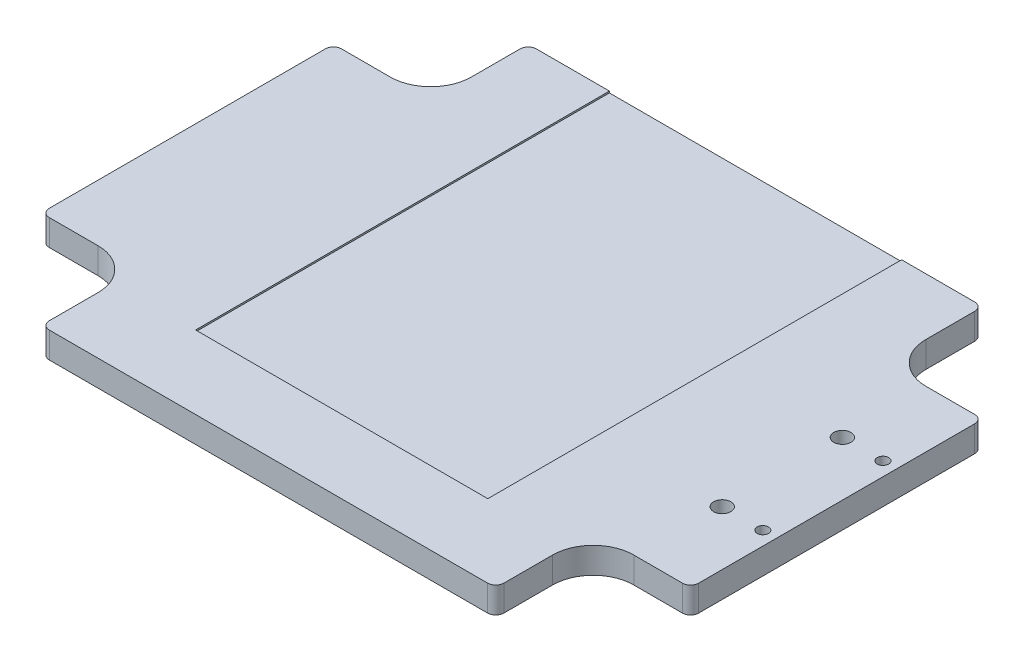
ISO-10303-21;
HEADER;
FILE_DESCRIPTION(('STEP AP214'),'2;1');
FILE_NAME('part.step','',(''),(''),'','','');
FILE_SCHEMA(('AUTOMOTIVE_DESIGN { 1 0 10303 214 1 1 1 1 }'));
ENDSEC;
DATA;
#1=APPLICATION_CONTEXT('core data for automotive mechanical design processes');
#2=APPLICATION_PROTOCOL_DEFINITION('international standard','automotive_design',2000,#1);
#3=PRODUCT_CONTEXT('',#1,'mechanical');
#4=PRODUCT('Part','Part','',(#3));
#5=PRODUCT_RELATED_PRODUCT_CATEGORY('part','',(#4));
#6=PRODUCT_DEFINITION_FORMATION('','',#4);
#7=PRODUCT_DEFINITION_CONTEXT('part definition',#1,'design');
#8=PRODUCT_DEFINITION('design','',#6,#7);
#9=PRODUCT_DEFINITION_SHAPE('','',#8);
#10=(LENGTH_UNIT() NAMED_UNIT(*) SI_UNIT(.MILLI.,.METRE.));
#11=(NAMED_UNIT(*) PLANE_ANGLE_UNIT() SI_UNIT($,.RADIAN.));
#12=(NAMED_UNIT(*) SI_UNIT($,.STERADIAN.) SOLID_ANGLE_UNIT());
#13=UNCERTAINTY_MEASURE_WITH_UNIT(LENGTH_MEASURE(1.E-05),#10,'distance_accuracy_value','');
#14=(GEOMETRIC_REPRESENTATION_CONTEXT(3) GLOBAL_UNCERTAINTY_ASSIGNED_CONTEXT((#13)) GLOBAL_UNIT_ASSIGNED_CONTEXT((#10,
#11,#12)) REPRESENTATION_CONTEXT('',''));
#15=CARTESIAN_POINT('',(0.,0.,0.));
#16=DIRECTION('',(0.,0.,1.));
#17=DIRECTION('',(1.,0.,0.));
#18=AXIS2_PLACEMENT_3D('',#15,#16,#17);
#19=CARTESIAN_POINT('',(16.5,1.6,-11.5));
#20=DIRECTION('',(0.,1.,0.));
#21=DIRECTION('',(0.,0.,1.));
#22=AXIS2_PLACEMENT_3D('',#19,#20,#21);
#23=PLANE('',#22);
#24=DIRECTION('',(0.,0.,1.));
#25=VECTOR('',#24,1.);
#26=CARTESIAN_POINT('',(-9.,1.6,10.49));
#27=LINE('',#26,#25);
#28=CARTESIAN_POINT('',(-9.,1.6,-15.));
#29=VERTEX_POINT('',#28);
#30=CARTESIAN_POINT('',(-9.,1.6,10.49));
#31=VERTEX_POINT('',#30);
#32=EDGE_CURVE('E1174',#29,#31,#27,.T.);
#33=ORIENTED_EDGE('',*,*,#32,.F.);
#34=DIRECTION('',(-1.,0.,0.));
#35=VECTOR('',#34,1.);
#36=CARTESIAN_POINT('',(-13.5,1.6,-15.));
#37=LINE('',#36,#35);
#38=CARTESIAN_POINT('',(-13.5,1.6,-15.));
#39=VERTEX_POINT('',#38);
#40=EDGE_CURVE('E1266',#29,#39,#37,.T.);
#41=ORIENTED_EDGE('',*,*,#40,.T.);
#42=CARTESIAN_POINT('',(-13.5,1.6,-14.5));
#43=DIRECTION('',(0.,1.,0.));
#44=DIRECTION('',(0.,0.,-1.));
#45=AXIS2_PLACEMENT_3D('',#42,#43,#44);
#46=CIRCLE('',#45,0.5);
#47=CARTESIAN_POINT('',(-14.,1.6,-14.5));
#48=VERTEX_POINT('',#47);
#49=EDGE_CURVE('E1271',#39,#48,#46,.T.);
#50=ORIENTED_EDGE('',*,*,#49,.T.);
#51=DIRECTION('',(0.,0.,1.));
#52=VECTOR('',#51,1.);
#53=CARTESIAN_POINT('',(-14.,1.6,-11.5));
#54=LINE('',#53,#52);
#55=CARTESIAN_POINT('',(-14.,1.6,-11.5));
#56=VERTEX_POINT('',#55);
#57=EDGE_CURVE('E1274',#48,#56,#54,.T.);
#58=ORIENTED_EDGE('',*,*,#57,.T.);
#59=CARTESIAN_POINT('',(-16.5,1.6,-11.5));
#60=DIRECTION('',(0.,-1.,0.));
#61=DIRECTION('',(0.,0.,1.));
#62=AXIS2_PLACEMENT_3D('',#59,#60,#61);
#63=CIRCLE('',#62,2.5);
#64=CARTESIAN_POINT('',(-16.5,1.6,-9.));
#65=VERTEX_POINT('',#64);
#66=EDGE_CURVE('E1277',#56,#65,#63,.T.);
#67=ORIENTED_EDGE('',*,*,#66,.T.);
#68=DIRECTION('',(-1.,0.,0.));
#69=VECTOR('',#68,1.);
#70=CARTESIAN_POINT('',(-19.5,1.6,-9.));
#71=LINE('',#70,#69);
#72=CARTESIAN_POINT('',(-19.5,1.6,-9.));
#73=VERTEX_POINT('',#72);
#74=EDGE_CURVE('E1280',#65,#73,#71,.T.);
#75=ORIENTED_EDGE('',*,*,#74,.T.);
#76=CARTESIAN_POINT('',(-19.5,1.6,-8.5));
#77=DIRECTION('',(0.,1.,0.));
#78=DIRECTION('',(0.,0.,1.));
#79=AXIS2_PLACEMENT_3D('',#76,#77,#78);
#80=CIRCLE('',#79,0.5);
#81=CARTESIAN_POINT('',(-20.,1.6,-8.49999999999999));
#82=VERTEX_POINT('',#81);
#83=EDGE_CURVE('E1283',#73,#82,#80,.T.);
#84=ORIENTED_EDGE('',*,*,#83,.T.);
#85=DIRECTION('',(0.,0.,1.));
#86=VECTOR('',#85,1.);
#87=CARTESIAN_POINT('',(-20.,1.6,8.49999999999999));
#88=LINE('',#87,#86);
#89=CARTESIAN_POINT('',(-20.,1.6,8.49999999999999));
#90=VERTEX_POINT('',#89);
#91=EDGE_CURVE('E1286',#82,#90,#88,.T.);
#92=ORIENTED_EDGE('',*,*,#91,.T.);
#93=CARTESIAN_POINT('',(-19.5,1.6,8.5));
#94=DIRECTION('',(0.,1.,0.));
#95=DIRECTION('',(0.,0.,-1.));
#96=AXIS2_PLACEMENT_3D('',#93,#94,#95);
#97=CIRCLE('',#96,0.5);
#98=CARTESIAN_POINT('',(-19.5,1.6,9.));
#99=VERTEX_POINT('',#98);
#100=EDGE_CURVE('E1289',#90,#99,#97,.T.);
#101=ORIENTED_EDGE('',*,*,#100,.T.);
#102=DIRECTION('',(1.,0.,0.));
#103=VECTOR('',#102,1.);
#104=CARTESIAN_POINT('',(-16.5,1.6,9.));
#105=LINE('',#104,#103);
#106=CARTESIAN_POINT('',(-16.5,1.6,9.));
#107=VERTEX_POINT('',#106);
#108=EDGE_CURVE('E1292',#99,#107,#105,.T.);
#109=ORIENTED_EDGE('',*,*,#108,.T.);
#110=CARTESIAN_POINT('',(-16.5,1.6,11.5));
#111=DIRECTION('',(0.,-1.,0.));
#112=DIRECTION('',(0.,0.,1.));
#113=AXIS2_PLACEMENT_3D('',#110,#111,#112);
#114=CIRCLE('',#113,2.5);
#115=CARTESIAN_POINT('',(-14.,1.6,11.5));
#116=VERTEX_POINT('',#115);
#117=EDGE_CURVE('E1295',#107,#116,#114,.T.);
#118=ORIENTED_EDGE('',*,*,#117,.T.);
#119=DIRECTION('',(0.,0.,1.));
#120=VECTOR('',#119,1.);
#121=CARTESIAN_POINT('',(-14.,1.6,14.5));
#122=LINE('',#121,#120);
#123=CARTESIAN_POINT('',(-14.,1.6,14.5));
#124=VERTEX_POINT('',#123);
#125=EDGE_CURVE('E1298',#116,#124,#122,.T.);
#126=ORIENTED_EDGE('',*,*,#125,.T.);
#127=CARTESIAN_POINT('',(-13.5,1.6,14.5));
#128=DIRECTION('',(0.,1.,0.));
#129=DIRECTION('',(0.,0.,-1.));
#130=AXIS2_PLACEMENT_3D('',#127,#128,#129);
#131=CIRCLE('',#130,0.5);
#132=CARTESIAN_POINT('',(-13.5,1.6,15.));
#133=VERTEX_POINT('',#132);
#134=EDGE_CURVE('E1301',#124,#133,#131,.T.);
#135=ORIENTED_EDGE('',*,*,#134,.T.);
#136=DIRECTION('',(1.,0.,0.));
#137=VECTOR('',#136,1.);
#138=CARTESIAN_POINT('',(13.5,1.6,15.));
#139=LINE('',#138,#137);
#140=CARTESIAN_POINT('',(13.5,1.6,15.));
#141=VERTEX_POINT('',#140);
#142=EDGE_CURVE('E1304',#133,#141,#139,.T.);
#143=ORIENTED_EDGE('',*,*,#142,.T.);
#144=CARTESIAN_POINT('',(13.5,1.6,14.5));
#145=DIRECTION('',(0.,1.,0.));
#146=DIRECTION('',(0.,0.,-1.));
#147=AXIS2_PLACEMENT_3D('',#144,#145,#146);
#148=CIRCLE('',#147,0.5);
#149=CARTESIAN_POINT('',(14.,1.6,14.5));
#150=VERTEX_POINT('',#149);
#151=EDGE_CURVE('E1307',#141,#150,#148,.T.);
#152=ORIENTED_EDGE('',*,*,#151,.T.);
#153=DIRECTION('',(0.,0.,-1.));
#154=VECTOR('',#153,1.);
#155=CARTESIAN_POINT('',(14.,1.6,11.5));
#156=LINE('',#155,#154);
#157=CARTESIAN_POINT('',(14.,1.6,11.5));
#158=VERTEX_POINT('',#157);
#159=EDGE_CURVE('E1310',#150,#158,#156,.T.);
#160=ORIENTED_EDGE('',*,*,#159,.T.);
#161=CARTESIAN_POINT('',(16.5,1.6,11.5));
#162=DIRECTION('',(0.,-1.,0.));
#163=DIRECTION('',(0.,0.,1.));
#164=AXIS2_PLACEMENT_3D('',#161,#162,#163);
#165=CIRCLE('',#164,2.5);
#166=CARTESIAN_POINT('',(16.5,1.6,9.));
#167=VERTEX_POINT('',#166);
#168=EDGE_CURVE('E1313',#158,#167,#165,.T.);
#169=ORIENTED_EDGE('',*,*,#168,.T.);
#170=DIRECTION('',(1.,0.,0.));
#171=VECTOR('',#170,1.);
#172=CARTESIAN_POINT('',(19.5,1.6,9.));
#173=LINE('',#172,#171);
#174=CARTESIAN_POINT('',(19.5,1.6,9.));
#175=VERTEX_POINT('',#174);
#176=EDGE_CURVE('E1316',#167,#175,#173,.T.);
#177=ORIENTED_EDGE('',*,*,#176,.T.);
#178=CARTESIAN_POINT('',(19.5,1.6,8.5));
#179=DIRECTION('',(0.,1.,0.));
#180=DIRECTION('',(0.,0.,-1.));
#181=AXIS2_PLACEMENT_3D('',#178,#179,#180);
#182=CIRCLE('',#181,0.5);
#183=CARTESIAN_POINT('',(20.,1.6,8.49999999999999));
#184=VERTEX_POINT('',#183);
#185=EDGE_CURVE('E1319',#175,#184,#182,.T.);
#186=ORIENTED_EDGE('',*,*,#185,.T.);
#187=DIRECTION('',(0.,0.,-1.));
#188=VECTOR('',#187,1.);
#189=CARTESIAN_POINT('',(20.,1.6,-8.5));
#190=LINE('',#189,#188);
#191=CARTESIAN_POINT('',(20.,1.6,-8.5));
#192=VERTEX_POINT('',#191);
#193=EDGE_CURVE('E1322',#184,#192,#190,.T.);
#194=ORIENTED_EDGE('',*,*,#193,.T.);
#195=CARTESIAN_POINT('',(19.5,1.6,-8.5));
#196=DIRECTION('',(0.,1.,0.));
#197=DIRECTION('',(0.,0.,-1.));
#198=AXIS2_PLACEMENT_3D('',#195,#196,#197);
#199=CIRCLE('',#198,0.5);
#200=CARTESIAN_POINT('',(19.5,1.6,-9.));
#201=VERTEX_POINT('',#200);
#202=EDGE_CURVE('E1325',#192,#201,#199,.T.);
#203=ORIENTED_EDGE('',*,*,#202,.T.);
#204=DIRECTION('',(-1.,0.,0.));
#205=VECTOR('',#204,1.);
#206=CARTESIAN_POINT('',(16.5,1.6,-9.));
#207=LINE('',#206,#205);
#208=CARTESIAN_POINT('',(16.5,1.6,-9.));
#209=VERTEX_POINT('',#208);
#210=EDGE_CURVE('E1328',#201,#209,#207,.T.);
#211=ORIENTED_EDGE('',*,*,#210,.T.);
#212=CARTESIAN_POINT('',(16.5,1.6,-11.5));
#213=DIRECTION('',(0.,-1.,0.));
#214=DIRECTION('',(0.,0.,1.));
#215=AXIS2_PLACEMENT_3D('',#212,#213,#214);
#216=CIRCLE('',#215,2.5);
#217=CARTESIAN_POINT('',(14.,1.6,-11.5));
#218=VERTEX_POINT('',#217);
#219=EDGE_CURVE('E1255',#209,#218,#216,.T.);
#220=ORIENTED_EDGE('',*,*,#219,.T.);
#221=DIRECTION('',(0.,0.,-1.));
#222=VECTOR('',#221,1.);
#223=CARTESIAN_POINT('',(14.,1.6,-14.5));
#224=LINE('',#223,#222);
#225=CARTESIAN_POINT('',(14.,1.6,-14.5));
#226=VERTEX_POINT('',#225);
#227=EDGE_CURVE('E1259',#218,#226,#224,.T.);
#228=ORIENTED_EDGE('',*,*,#227,.T.);
#229=CARTESIAN_POINT('',(13.5,1.6,-14.5));
#230=DIRECTION('',(0.,1.,0.));
#231=DIRECTION('',(0.,0.,-1.));
#232=AXIS2_PLACEMENT_3D('',#229,#230,#231);
#233=CIRCLE('',#232,0.5);
#234=CARTESIAN_POINT('',(13.5,1.6,-15.));
#235=VERTEX_POINT('',#234);
#236=EDGE_CURVE('E1263',#226,#235,#233,.T.);
#237=ORIENTED_EDGE('',*,*,#236,.T.);
#238=CARTESIAN_POINT('',(9.,1.6,-15.));
#239=VERTEX_POINT('',#238);
#240=EDGE_CURVE('E1267',#235,#239,#37,.T.);
#241=ORIENTED_EDGE('',*,*,#240,.T.);
#242=DIRECTION('',(0.,0.,-1.));
#243=VECTOR('',#242,1.);
#244=CARTESIAN_POINT('',(9.,1.6,10.49));
#245=LINE('',#244,#243);
#246=CARTESIAN_POINT('',(9.,1.6,10.49));
#247=VERTEX_POINT('',#246);
#248=EDGE_CURVE('E1189',#247,#239,#245,.T.);
#249=ORIENTED_EDGE('',*,*,#248,.F.);
#250=DIRECTION('',(1.,0.,0.));
#251=VECTOR('',#250,1.);
#252=CARTESIAN_POINT('',(-9.,1.6,10.49));
#253=LINE('',#252,#251);
#254=EDGE_CURVE('E1204',#31,#247,#253,.T.);
#255=ORIENTED_EDGE('',*,*,#254,.F.);
#256=EDGE_LOOP('',(#33,#41,#50,#58,#67,#75,#84,#92,#101,#109,#118,#126,#135,#143,#152,#160,#169,
#177,#186,#194,#203,#211,#220,#228,#237,#241,#249,#255));
#257=FACE_BOUND('',#256,.T.);
#258=CARTESIAN_POINT('',(19.15,1.6,-3.7));
#259=DIRECTION('',(0.,1.,0.));
#260=DIRECTION('',(0.,0.,1.));
#261=AXIS2_PLACEMENT_3D('',#258,#259,#260);
#262=CIRCLE('',#261,0.350000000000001);
#263=CARTESIAN_POINT('',(19.15,1.6,-3.35));
#264=VERTEX_POINT('',#263);
#265=EDGE_CURVE('E1231',#264,#264,#262,.T.);
#266=ORIENTED_EDGE('',*,*,#265,.F.);
#267=EDGE_LOOP('',(#266));
#268=FACE_BOUND('',#267,.T.);
#269=CARTESIAN_POINT('',(16.65,1.6,3.7));
#270=DIRECTION('',(0.,1.,0.));
#271=DIRECTION('',(0.,0.,1.));
#272=AXIS2_PLACEMENT_3D('',#269,#270,#271);
#273=CIRCLE('',#272,0.529999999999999);
#274=CARTESIAN_POINT('',(16.65,1.6,4.23));
#275=VERTEX_POINT('',#274);
#276=EDGE_CURVE('E1247',#275,#275,#273,.T.);
#277=ORIENTED_EDGE('',*,*,#276,.F.);
#278=EDGE_LOOP('',(#277));
#279=FACE_BOUND('',#278,.T.);
#280=CARTESIAN_POINT('',(19.15,1.6,3.7));
#281=DIRECTION('',(0.,1.,0.));
#282=DIRECTION('',(0.,0.,1.));
#283=AXIS2_PLACEMENT_3D('',#280,#281,#282);
#284=CIRCLE('',#283,0.350000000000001);
#285=CARTESIAN_POINT('',(19.15,1.6,4.05));
#286=VERTEX_POINT('',#285);
#287=EDGE_CURVE('E1239',#286,#286,#284,.T.);
#288=ORIENTED_EDGE('',*,*,#287,.F.);
#289=EDGE_LOOP('',(#288));
#290=FACE_BOUND('',#289,.T.);
#291=CARTESIAN_POINT('',(16.65,1.6,-3.7));
#292=DIRECTION('',(0.,1.,0.));
#293=DIRECTION('',(0.,0.,1.));
#294=AXIS2_PLACEMENT_3D('',#291,#292,#293);
#295=CIRCLE('',#294,0.529999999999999);
#296=CARTESIAN_POINT('',(16.65,1.6,-3.17));
#297=VERTEX_POINT('',#296);
#298=EDGE_CURVE('E1223',#297,#297,#295,.T.);
#299=ORIENTED_EDGE('',*,*,#298,.F.);
#300=EDGE_LOOP('',(#299));
#301=FACE_BOUND('',#300,.T.);
#302=ADVANCED_FACE('F39',(#257,#268,#279,#290,#301),#23,.T.);
#303=CARTESIAN_POINT('',(16.5,0.,-11.5));
#304=DIRECTION('',(0.,1.,0.));
#305=DIRECTION('',(0.,0.,1.));
#306=AXIS2_PLACEMENT_3D('',#303,#304,#305);
#307=PLANE('',#306);
#308=DIRECTION('',(0.,0.,1.));
#309=VECTOR('',#308,1.);
#310=CARTESIAN_POINT('',(-6.69999999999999,0.,12.6000000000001));
#311=LINE('',#310,#309);
#312=CARTESIAN_POINT('',(-6.69999999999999,0.,12.6000000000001));
#313=VERTEX_POINT('',#312);
#314=CARTESIAN_POINT('',(-6.7,0.,14.6000000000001));
#315=VERTEX_POINT('',#314);
#316=EDGE_CURVE('E943',#313,#315,#311,.T.);
#317=ORIENTED_EDGE('',*,*,#316,.F.);
#318=DIRECTION('',(1.,0.,0.));
#319=VECTOR('',#318,1.);
#320=CARTESIAN_POINT('',(-6.69999999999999,0.,12.6000000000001));
#321=LINE('',#320,#319);
#322=CARTESIAN_POINT('',(-7.89999999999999,0.,12.6000000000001));
#323=VERTEX_POINT('',#322);
#324=EDGE_CURVE('E55',#323,#313,#321,.T.);
#325=ORIENTED_EDGE('',*,*,#324,.F.);
#326=DIRECTION('',(0.,0.,-1.));
#327=VECTOR('',#326,1.);
#328=CARTESIAN_POINT('',(-7.89999999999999,0.,12.6000000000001));
#329=LINE('',#328,#327);
#330=CARTESIAN_POINT('',(-7.9,0.,14.6000000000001));
#331=VERTEX_POINT('',#330);
#332=EDGE_CURVE('E928',#331,#323,#329,.T.);
#333=ORIENTED_EDGE('',*,*,#332,.F.);
#334=DIRECTION('',(-1.,0.,0.));
#335=VECTOR('',#334,1.);
#336=CARTESIAN_POINT('',(-6.7,0.,14.6000000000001));
#337=LINE('',#336,#335);
#338=EDGE_CURVE('E947',#315,#331,#337,.T.);
#339=ORIENTED_EDGE('',*,*,#338,.F.);
#340=EDGE_LOOP('',(#317,#325,#333,#339));
#341=FACE_BOUND('',#340,.T.);
#342=DIRECTION('',(1.,0.,0.));
#343=VECTOR('',#342,1.);
#344=CARTESIAN_POINT('',(-13.7,0.,7.1));
#345=LINE('',#344,#343);
#346=CARTESIAN_POINT('',(-13.7,0.,7.1));
#347=VERTEX_POINT('',#346);
#348=CARTESIAN_POINT('',(-10.3,0.,7.1));
#349=VERTEX_POINT('',#348);
#350=EDGE_CURVE('E901',#347,#349,#345,.T.);
#351=ORIENTED_EDGE('',*,*,#350,.F.);
#352=DIRECTION('',(0.,0.,-1.));
#353=VECTOR('',#352,1.);
#354=CARTESIAN_POINT('',(-13.7,0.,7.1));
#355=LINE('',#354,#353);
#356=CARTESIAN_POINT('',(-13.7,0.,8.7));
#357=VERTEX_POINT('',#356);
#358=EDGE_CURVE('E63',#357,#347,#355,.T.);
#359=ORIENTED_EDGE('',*,*,#358,.F.);
#360=DIRECTION('',(-1.,0.,0.));
#361=VECTOR('',#360,1.);
#362=CARTESIAN_POINT('',(-13.7,0.,8.7));
#363=LINE('',#362,#361);
#364=CARTESIAN_POINT('',(-10.3,0.,8.7));
#365=VERTEX_POINT('',#364);
#366=EDGE_CURVE('E886',#365,#357,#363,.T.);
#367=ORIENTED_EDGE('',*,*,#366,.F.);
#368=DIRECTION('',(0.,0.,1.));
#369=VECTOR('',#368,1.);
#370=CARTESIAN_POINT('',(-10.3,0.,7.1));
#371=LINE('',#370,#369);
#372=EDGE_CURVE('E906',#349,#365,#371,.T.);
#373=ORIENTED_EDGE('',*,*,#372,.F.);
#374=EDGE_LOOP('',(#351,#359,#367,#373));
#375=FACE_BOUND('',#374,.T.);
#376=DIRECTION('',(1.,0.,0.));
#377=VECTOR('',#376,1.);
#378=CARTESIAN_POINT('',(-13.7,0.,0.300000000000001));
#379=LINE('',#378,#377);
#380=CARTESIAN_POINT('',(-13.7,0.,0.3));
#381=VERTEX_POINT('',#380);
#382=CARTESIAN_POINT('',(-10.3,0.,0.3));
#383=VERTEX_POINT('',#382);
#384=EDGE_CURVE('E858',#381,#383,#379,.T.);
#385=ORIENTED_EDGE('',*,*,#384,.F.);
#386=DIRECTION('',(0.,0.,-1.));
#387=VECTOR('',#386,1.);
#388=CARTESIAN_POINT('',(-13.7,0.,1.9));
#389=LINE('',#388,#387);
#390=CARTESIAN_POINT('',(-13.7,0.,1.9));
#391=VERTEX_POINT('',#390);
#392=EDGE_CURVE('E855',#391,#381,#389,.T.);
#393=ORIENTED_EDGE('',*,*,#392,.F.);
#394=DIRECTION('',(-1.,0.,0.));
#395=VECTOR('',#394,1.);
#396=CARTESIAN_POINT('',(-13.7,0.,1.9));
#397=LINE('',#396,#395);
#398=CARTESIAN_POINT('',(-10.3,0.,1.9));
#399=VERTEX_POINT('',#398);
#400=EDGE_CURVE('E842',#399,#391,#397,.T.);
#401=ORIENTED_EDGE('',*,*,#400,.F.);
#402=DIRECTION('',(0.,0.,1.));
#403=VECTOR('',#402,1.);
#404=CARTESIAN_POINT('',(-10.3,0.,1.9));
#405=LINE('',#404,#403);
#406=EDGE_CURVE('E863',#383,#399,#405,.T.);
#407=ORIENTED_EDGE('',*,*,#406,.F.);
#408=EDGE_LOOP('',(#385,#393,#401,#407));
#409=FACE_BOUND('',#408,.T.);
#410=DIRECTION('',(1.,0.,0.));
#411=VECTOR('',#410,1.);
#412=CARTESIAN_POINT('',(-19.5,0.,5.));
#413=LINE('',#412,#411);
#414=CARTESIAN_POINT('',(-19.5,0.,5.));
#415=VERTEX_POINT('',#414);
#416=CARTESIAN_POINT('',(-14.9,0.,5.));
#417=VERTEX_POINT('',#416);
#418=EDGE_CURVE('E812',#415,#417,#413,.T.);
#419=ORIENTED_EDGE('',*,*,#418,.F.);
#420=DIRECTION('',(0.,0.,-1.));
#421=VECTOR('',#420,1.);
#422=CARTESIAN_POINT('',(-19.5,0.,5.));
#423=LINE('',#422,#421);
#424=CARTESIAN_POINT('',(-19.5,0.,6.));
#425=VERTEX_POINT('',#424);
#426=EDGE_CURVE('E809',#425,#415,#423,.T.);
#427=ORIENTED_EDGE('',*,*,#426,.F.);
#428=DIRECTION('',(-1.,0.,0.));
#429=VECTOR('',#428,1.);
#430=CARTESIAN_POINT('',(-19.5,0.,6.));
#431=LINE('',#430,#429);
#432=CARTESIAN_POINT('',(-14.9,0.,6.));
#433=VERTEX_POINT('',#432);
#434=EDGE_CURVE('E796',#433,#425,#431,.T.);
#435=ORIENTED_EDGE('',*,*,#434,.F.);
#436=DIRECTION('',(0.,0.,1.));
#437=VECTOR('',#436,1.);
#438=CARTESIAN_POINT('',(-14.9,0.,5.));
#439=LINE('',#438,#437);
#440=EDGE_CURVE('E817',#417,#433,#439,.T.);
#441=ORIENTED_EDGE('',*,*,#440,.F.);
#442=EDGE_LOOP('',(#419,#427,#435,#441));
#443=FACE_BOUND('',#442,.T.);
#444=DIRECTION('',(1.,0.,0.));
#445=VECTOR('',#444,1.);
#446=CARTESIAN_POINT('',(-19.5,0.,3.));
#447=LINE('',#446,#445);
#448=CARTESIAN_POINT('',(-19.5,0.,3.));
#449=VERTEX_POINT('',#448);
#450=CARTESIAN_POINT('',(-14.9,0.,3.));
#451=VERTEX_POINT('',#450);
#452=EDGE_CURVE('E1118',#449,#451,#447,.T.);
#453=ORIENTED_EDGE('',*,*,#452,.F.);
#454=DIRECTION('',(0.,0.,-1.));
#455=VECTOR('',#454,1.);
#456=CARTESIAN_POINT('',(-19.5,0.,3.));
#457=LINE('',#456,#455);
#458=CARTESIAN_POINT('',(-19.5,0.,4.));
#459=VERTEX_POINT('',#458);
#460=EDGE_CURVE('E827',#459,#449,#457,.T.);
#461=ORIENTED_EDGE('',*,*,#460,.F.);
#462=DIRECTION('',(-1.,0.,0.));
#463=VECTOR('',#462,1.);
#464=CARTESIAN_POINT('',(-19.5,0.,4.));
#465=LINE('',#464,#463);
#466=CARTESIAN_POINT('',(-14.9,0.,4.));
#467=VERTEX_POINT('',#466);
#468=EDGE_CURVE('E1103',#467,#459,#465,.T.);
#469=ORIENTED_EDGE('',*,*,#468,.F.);
#470=DIRECTION('',(0.,0.,1.));
#471=VECTOR('',#470,1.);
#472=CARTESIAN_POINT('',(-14.9,0.,3.));
#473=LINE('',#472,#471);
#474=EDGE_CURVE('E1122',#451,#467,#473,.T.);
#475=ORIENTED_EDGE('',*,*,#474,.F.);
#476=EDGE_LOOP('',(#453,#461,#469,#475));
#477=FACE_BOUND('',#476,.T.);
#478=DIRECTION('',(1.,0.,0.));
#479=VECTOR('',#478,1.);
#480=CARTESIAN_POINT('',(-13.7,0.,-1.9));
#481=LINE('',#480,#479);
#482=CARTESIAN_POINT('',(-13.7,0.,-1.9));
#483=VERTEX_POINT('',#482);
#484=CARTESIAN_POINT('',(-10.3,0.,-1.9));
#485=VERTEX_POINT('',#484);
#486=EDGE_CURVE('E1075',#483,#485,#481,.T.);
#487=ORIENTED_EDGE('',*,*,#486,.F.);
#488=DIRECTION('',(0.,0.,-1.));
#489=VECTOR('',#488,1.);
#490=CARTESIAN_POINT('',(-13.7,0.,-1.9));
#491=LINE('',#490,#489);
#492=CARTESIAN_POINT('',(-13.7,0.,-0.299999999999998));
#493=VERTEX_POINT('',#492);
#494=EDGE_CURVE('E1072',#493,#483,#491,.T.);
#495=ORIENTED_EDGE('',*,*,#494,.F.);
#496=DIRECTION('',(-1.,0.,0.));
#497=VECTOR('',#496,1.);
#498=CARTESIAN_POINT('',(-13.7,0.,-0.299999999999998));
#499=LINE('',#498,#497);
#500=CARTESIAN_POINT('',(-10.3,0.,-0.299999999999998));
#501=VERTEX_POINT('',#500);
#502=EDGE_CURVE('E1059',#501,#493,#499,.T.);
#503=ORIENTED_EDGE('',*,*,#502,.F.);
#504=DIRECTION('',(0.,0.,1.));
#505=VECTOR('',#504,1.);
#506=CARTESIAN_POINT('',(-10.3,0.,-1.9));
#507=LINE('',#506,#505);
#508=EDGE_CURVE('E1080',#485,#501,#507,.T.);
#509=ORIENTED_EDGE('',*,*,#508,.F.);
#510=EDGE_LOOP('',(#487,#495,#503,#509));
#511=FACE_BOUND('',#510,.T.);
#512=DIRECTION('',(1.,0.,0.));
#513=VECTOR('',#512,1.);
#514=CARTESIAN_POINT('',(-13.7,0.,-8.7));
#515=LINE('',#514,#513);
#516=CARTESIAN_POINT('',(-13.7,0.,-8.7));
#517=VERTEX_POINT('',#516);
#518=CARTESIAN_POINT('',(-10.3,0.,-8.7));
#519=VERTEX_POINT('',#518);
#520=EDGE_CURVE('E1031',#517,#519,#515,.T.);
#521=ORIENTED_EDGE('',*,*,#520,.F.);
#522=DIRECTION('',(0.,0.,-1.));
#523=VECTOR('',#522,1.);
#524=CARTESIAN_POINT('',(-13.7,0.,-7.1));
#525=LINE('',#524,#523);
#526=CARTESIAN_POINT('',(-13.7,0.,-7.1));
#527=VERTEX_POINT('',#526);
#528=EDGE_CURVE('E1028',#527,#517,#525,.T.);
#529=ORIENTED_EDGE('',*,*,#528,.F.);
#530=DIRECTION('',(-1.,0.,0.));
#531=VECTOR('',#530,1.);
#532=CARTESIAN_POINT('',(-13.7,0.,-7.1));
#533=LINE('',#532,#531);
#534=CARTESIAN_POINT('',(-10.3,0.,-7.1));
#535=VERTEX_POINT('',#534);
#536=EDGE_CURVE('E1015',#535,#527,#533,.T.);
#537=ORIENTED_EDGE('',*,*,#536,.F.);
#538=DIRECTION('',(0.,0.,1.));
#539=VECTOR('',#538,1.);
#540=CARTESIAN_POINT('',(-10.3,0.,-7.1));
#541=LINE('',#540,#539);
#542=EDGE_CURVE('E1036',#519,#535,#541,.T.);
#543=ORIENTED_EDGE('',*,*,#542,.F.);
#544=EDGE_LOOP('',(#521,#529,#537,#543));
#545=FACE_BOUND('',#544,.T.);
#546=DIRECTION('',(1.,0.,0.));
#547=VECTOR('',#546,1.);
#548=CARTESIAN_POINT('',(-19.5,0.,-4.));
#549=LINE('',#548,#547);
#550=CARTESIAN_POINT('',(-19.5,0.,-4.));
#551=VERTEX_POINT('',#550);
#552=CARTESIAN_POINT('',(-14.9,0.,-4.));
#553=VERTEX_POINT('',#552);
#554=EDGE_CURVE('E985',#551,#553,#549,.T.);
#555=ORIENTED_EDGE('',*,*,#554,.F.);
#556=DIRECTION('',(0.,0.,-1.));
#557=VECTOR('',#556,1.);
#558=CARTESIAN_POINT('',(-19.5,0.,-4.));
#559=LINE('',#558,#557);
#560=CARTESIAN_POINT('',(-19.5,0.,-3.));
#561=VERTEX_POINT('',#560);
#562=EDGE_CURVE('E982',#561,#551,#559,.T.);
#563=ORIENTED_EDGE('',*,*,#562,.F.);
#564=DIRECTION('',(-1.,0.,0.));
#565=VECTOR('',#564,1.);
#566=CARTESIAN_POINT('',(-19.5,0.,-3.));
#567=LINE('',#566,#565);
#568=CARTESIAN_POINT('',(-14.9,0.,-3.));
#569=VERTEX_POINT('',#568);
#570=EDGE_CURVE('E969',#569,#561,#567,.T.);
#571=ORIENTED_EDGE('',*,*,#570,.F.);
#572=DIRECTION('',(0.,0.,1.));
#573=VECTOR('',#572,1.);
#574=CARTESIAN_POINT('',(-14.9,0.,-4.));
#575=LINE('',#574,#573);
#576=EDGE_CURVE('E990',#553,#569,#575,.T.);
#577=ORIENTED_EDGE('',*,*,#576,.F.);
#578=EDGE_LOOP('',(#555,#563,#571,#577));
#579=FACE_BOUND('',#578,.T.);
#580=DIRECTION('',(0.,0.,1.));
#581=VECTOR('',#580,1.);
#582=CARTESIAN_POINT('',(-8.29999999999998,0.,9.25000000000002));
#583=LINE('',#582,#581);
#584=CARTESIAN_POINT('',(-8.29999999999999,0.,9.25000000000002));
#585=VERTEX_POINT('',#584);
#586=CARTESIAN_POINT('',(-8.29999999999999,0.,10.6));
#587=VERTEX_POINT('',#586);
#588=EDGE_CURVE('E601',#585,#587,#583,.T.);
#589=ORIENTED_EDGE('',*,*,#588,.F.);
#590=DIRECTION('',(1.,0.,0.));
#591=VECTOR('',#590,1.);
#592=CARTESIAN_POINT('',(-8.29999999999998,0.,9.25000000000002));
#593=LINE('',#592,#591);
#594=CARTESIAN_POINT('',(-8.89999999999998,0.,9.25));
#595=VERTEX_POINT('',#594);
#596=EDGE_CURVE('E568',#595,#585,#593,.T.);
#597=ORIENTED_EDGE('',*,*,#596,.F.);
#598=DIRECTION('',(0.,0.,-1.));
#599=VECTOR('',#598,1.);
#600=CARTESIAN_POINT('',(-8.89999999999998,0.,9.25));
#601=LINE('',#600,#599);
#602=CARTESIAN_POINT('',(-8.89999999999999,0.,10.6));
#603=VERTEX_POINT('',#602);
#604=EDGE_CURVE('E588',#603,#595,#601,.T.);
#605=ORIENTED_EDGE('',*,*,#604,.F.);
#606=DIRECTION('',(-1.,0.,0.));
#607=VECTOR('',#606,1.);
#608=CARTESIAN_POINT('',(-8.29999999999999,0.,10.6));
#609=LINE('',#608,#607);
#610=EDGE_CURVE('E592',#587,#603,#609,.T.);
#611=ORIENTED_EDGE('',*,*,#610,.F.);
#612=EDGE_LOOP('',(#589,#597,#605,#611));
#613=FACE_BOUND('',#612,.T.);
#614=DIRECTION('',(0.,0.,1.));
#615=VECTOR('',#614,1.);
#616=CARTESIAN_POINT('',(-9.29999999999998,0.,9.24999999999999));
#617=LINE('',#616,#615);
#618=CARTESIAN_POINT('',(-9.29999999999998,0.,9.24999999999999));
#619=VERTEX_POINT('',#618);
#620=CARTESIAN_POINT('',(-9.29999999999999,0.,10.6));
#621=VERTEX_POINT('',#620);
#622=EDGE_CURVE('E637',#619,#621,#617,.T.);
#623=ORIENTED_EDGE('',*,*,#622,.F.);
#624=DIRECTION('',(1.,0.,0.));
#625=VECTOR('',#624,1.);
#626=CARTESIAN_POINT('',(-9.29999999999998,0.,9.24999999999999));
#627=LINE('',#626,#625);
#628=CARTESIAN_POINT('',(-9.89999999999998,0.,9.24999999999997));
#629=VERTEX_POINT('',#628);
#630=EDGE_CURVE('E634',#629,#619,#627,.T.);
#631=ORIENTED_EDGE('',*,*,#630,.F.);
#632=DIRECTION('',(0.,0.,-1.));
#633=VECTOR('',#632,1.);
#634=CARTESIAN_POINT('',(-9.89999999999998,0.,9.24999999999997));
#635=LINE('',#634,#633);
#636=CARTESIAN_POINT('',(-9.90000000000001,0.,10.6));
#637=VERTEX_POINT('',#636);
#638=EDGE_CURVE('E621',#637,#629,#635,.T.);
#639=ORIENTED_EDGE('',*,*,#638,.F.);
#640=DIRECTION('',(-1.,0.,0.));
#641=VECTOR('',#640,1.);
#642=CARTESIAN_POINT('',(-9.29999999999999,0.,10.6));
#643=LINE('',#642,#641);
#644=EDGE_CURVE('E642',#621,#637,#643,.T.);
#645=ORIENTED_EDGE('',*,*,#644,.F.);
#646=EDGE_LOOP('',(#623,#631,#639,#645));
#647=FACE_BOUND('',#646,.T.);
#648=DIRECTION('',(0.,0.,1.));
#649=VECTOR('',#648,1.);
#650=CARTESIAN_POINT('',(-10.3,0.,9.24999999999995));
#651=LINE('',#650,#649);
#652=CARTESIAN_POINT('',(-10.3,0.,9.24999999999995));
#653=VERTEX_POINT('',#652);
#654=CARTESIAN_POINT('',(-10.3,0.,10.6));
#655=VERTEX_POINT('',#654);
#656=EDGE_CURVE('E681',#653,#655,#651,.T.);
#657=ORIENTED_EDGE('',*,*,#656,.F.);
#658=DIRECTION('',(1.,0.,0.));
#659=VECTOR('',#658,1.);
#660=CARTESIAN_POINT('',(-10.3,0.,9.24999999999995));
#661=LINE('',#660,#659);
#662=CARTESIAN_POINT('',(-10.9,0.,9.24999999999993));
#663=VERTEX_POINT('',#662);
#664=EDGE_CURVE('E678',#663,#653,#661,.T.);
#665=ORIENTED_EDGE('',*,*,#664,.F.);
#666=DIRECTION('',(0.,0.,-1.));
#667=VECTOR('',#666,1.);
#668=CARTESIAN_POINT('',(-10.9,0.,9.24999999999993));
#669=LINE('',#668,#667);
#670=CARTESIAN_POINT('',(-10.9,0.,10.6));
#671=VERTEX_POINT('',#670);
#672=EDGE_CURVE('E665',#671,#663,#669,.T.);
#673=ORIENTED_EDGE('',*,*,#672,.F.);
#674=DIRECTION('',(-1.,0.,0.));
#675=VECTOR('',#674,1.);
#676=CARTESIAN_POINT('',(-10.3,0.,10.6));
#677=LINE('',#676,#675);
#678=EDGE_CURVE('E686',#655,#671,#677,.T.);
#679=ORIENTED_EDGE('',*,*,#678,.F.);
#680=EDGE_LOOP('',(#657,#665,#673,#679));
#681=FACE_BOUND('',#680,.T.);
#682=DIRECTION('',(0.,0.,1.));
#683=VECTOR('',#682,1.);
#684=CARTESIAN_POINT('',(-11.3,0.,9.24999999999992));
#685=LINE('',#684,#683);
#686=CARTESIAN_POINT('',(-11.3,0.,9.24999999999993));
#687=VERTEX_POINT('',#686);
#688=CARTESIAN_POINT('',(-11.3,0.,10.5999999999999));
#689=VERTEX_POINT('',#688);
#690=EDGE_CURVE('E725',#687,#689,#685,.T.);
#691=ORIENTED_EDGE('',*,*,#690,.F.);
#692=DIRECTION('',(1.,0.,0.));
#693=VECTOR('',#692,1.);
#694=CARTESIAN_POINT('',(-11.3,0.,9.24999999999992));
#695=LINE('',#694,#693);
#696=CARTESIAN_POINT('',(-11.9,0.,9.2499999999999));
#697=VERTEX_POINT('',#696);
#698=EDGE_CURVE('E722',#697,#687,#695,.T.);
#699=ORIENTED_EDGE('',*,*,#698,.F.);
#700=DIRECTION('',(0.,0.,-1.));
#701=VECTOR('',#700,1.);
#702=CARTESIAN_POINT('',(-11.9,0.,9.2499999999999));
#703=LINE('',#702,#701);
#704=CARTESIAN_POINT('',(-11.9,0.,10.5999999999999));
#705=VERTEX_POINT('',#704);
#706=EDGE_CURVE('E709',#705,#697,#703,.T.);
#707=ORIENTED_EDGE('',*,*,#706,.F.);
#708=DIRECTION('',(-1.,0.,0.));
#709=VECTOR('',#708,1.);
#710=CARTESIAN_POINT('',(-11.3,0.,10.5999999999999));
#711=LINE('',#710,#709);
#712=EDGE_CURVE('E730',#689,#705,#711,.T.);
#713=ORIENTED_EDGE('',*,*,#712,.F.);
#714=EDGE_LOOP('',(#691,#699,#707,#713));
#715=FACE_BOUND('',#714,.T.);
#716=DIRECTION('',(0.,0.,1.));
#717=VECTOR('',#716,1.);
#718=CARTESIAN_POINT('',(-12.3,0.,12.6));
#719=LINE('',#718,#717);
#720=CARTESIAN_POINT('',(-12.3,0.,12.6));
#721=VERTEX_POINT('',#720);
#722=CARTESIAN_POINT('',(-12.3,0.,14.6));
#723=VERTEX_POINT('',#722);
#724=EDGE_CURVE('E769',#721,#723,#719,.T.);
#725=ORIENTED_EDGE('',*,*,#724,.F.);
#726=DIRECTION('',(1.,0.,0.));
#727=VECTOR('',#726,1.);
#728=CARTESIAN_POINT('',(-12.3,0.,12.6));
#729=LINE('',#728,#727);
#730=CARTESIAN_POINT('',(-13.5,0.,12.6));
#731=VERTEX_POINT('',#730);
#732=EDGE_CURVE('E766',#731,#721,#729,.T.);
#733=ORIENTED_EDGE('',*,*,#732,.F.);
#734=DIRECTION('',(0.,0.,-1.));
#735=VECTOR('',#734,1.);
#736=CARTESIAN_POINT('',(-13.5,0.,12.6));
#737=LINE('',#736,#735);
#738=CARTESIAN_POINT('',(-13.5,0.,14.6));
#739=VERTEX_POINT('',#738);
#740=EDGE_CURVE('E753',#739,#731,#737,.T.);
#741=ORIENTED_EDGE('',*,*,#740,.F.);
#742=DIRECTION('',(-1.,0.,0.));
#743=VECTOR('',#742,1.);
#744=CARTESIAN_POINT('',(-12.3,0.,14.6));
#745=LINE('',#744,#743);
#746=EDGE_CURVE('E773',#723,#739,#745,.T.);
#747=ORIENTED_EDGE('',*,*,#746,.F.);
#748=EDGE_LOOP('',(#725,#733,#741,#747));
#749=FACE_BOUND('',#748,.T.);
#750=DIRECTION('',(1.,0.,0.));
#751=VECTOR('',#750,1.);
#752=CARTESIAN_POINT('',(-19.5,0.,-6.));
#753=LINE('',#752,#751);
#754=CARTESIAN_POINT('',(-19.5,0.,-6.));
#755=VERTEX_POINT('',#754);
#756=CARTESIAN_POINT('',(-14.9,0.,-6.));
#757=VERTEX_POINT('',#756);
#758=EDGE_CURVE('E1160',#755,#757,#753,.T.);
#759=ORIENTED_EDGE('',*,*,#758,.F.);
#760=DIRECTION('',(0.,0.,-1.));
#761=VECTOR('',#760,1.);
#762=CARTESIAN_POINT('',(-19.5,0.,-6.));
#763=LINE('',#762,#761);
#764=CARTESIAN_POINT('',(-19.5,0.,-5.));
#765=VERTEX_POINT('',#764);
#766=EDGE_CURVE('E1000',#765,#755,#763,.T.);
#767=ORIENTED_EDGE('',*,*,#766,.F.);
#768=DIRECTION('',(-1.,0.,0.));
#769=VECTOR('',#768,1.);
#770=CARTESIAN_POINT('',(-19.5,0.,-5.));
#771=LINE('',#770,#769);
#772=CARTESIAN_POINT('',(-14.9,0.,-5.));
#773=VERTEX_POINT('',#772);
#774=EDGE_CURVE('E1145',#773,#765,#771,.T.);
#775=ORIENTED_EDGE('',*,*,#774,.F.);
#776=DIRECTION('',(0.,0.,1.));
#777=VECTOR('',#776,1.);
#778=CARTESIAN_POINT('',(-14.9,0.,-6.));
#779=LINE('',#778,#777);
#780=EDGE_CURVE('E1164',#757,#773,#779,.T.);
#781=ORIENTED_EDGE('',*,*,#780,.F.);
#782=EDGE_LOOP('',(#759,#767,#775,#781));
#783=FACE_BOUND('',#782,.T.);
#784=CARTESIAN_POINT('',(16.5,0.,-11.5));
#785=DIRECTION('',(0.,-1.,0.));
#786=DIRECTION('',(0.,0.,1.));
#787=AXIS2_PLACEMENT_3D('',#784,#785,#786);
#788=CIRCLE('',#787,2.5);
#789=CARTESIAN_POINT('',(16.5,0.,-9.));
#790=VERTEX_POINT('',#789);
#791=CARTESIAN_POINT('',(14.,0.,-11.5));
#792=VERTEX_POINT('',#791);
#793=EDGE_CURVE('E1251',#790,#792,#788,.T.);
#794=ORIENTED_EDGE('',*,*,#793,.F.);
#795=DIRECTION('',(-1.,0.,0.));
#796=VECTOR('',#795,1.);
#797=CARTESIAN_POINT('',(16.5,0.,-9.));
#798=LINE('',#797,#796);
#799=CARTESIAN_POINT('',(19.5,0.,-9.));
#800=VERTEX_POINT('',#799);
#801=EDGE_CURVE('E1260',#800,#790,#798,.T.);
#802=ORIENTED_EDGE('',*,*,#801,.F.);
#803=CARTESIAN_POINT('',(19.5,0.,-8.5));
#804=DIRECTION('',(0.,1.,0.));
#805=DIRECTION('',(0.,0.,-1.));
#806=AXIS2_PLACEMENT_3D('',#803,#804,#805);
#807=CIRCLE('',#806,0.5);
#808=CARTESIAN_POINT('',(20.,0.,-8.5));
#809=VERTEX_POINT('',#808);
#810=EDGE_CURVE('E1398',#809,#800,#807,.T.);
#811=ORIENTED_EDGE('',*,*,#810,.F.);
#812=DIRECTION('',(0.,0.,-1.));
#813=VECTOR('',#812,1.);
#814=CARTESIAN_POINT('',(20.,0.,-8.5));
#815=LINE('',#814,#813);
#816=CARTESIAN_POINT('',(20.,0.,8.49999999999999));
#817=VERTEX_POINT('',#816);
#818=EDGE_CURVE('E1395',#817,#809,#815,.T.);
#819=ORIENTED_EDGE('',*,*,#818,.F.);
#820=CARTESIAN_POINT('',(19.5,0.,8.5));
#821=DIRECTION('',(0.,1.,0.));
#822=DIRECTION('',(0.,0.,-1.));
#823=AXIS2_PLACEMENT_3D('',#820,#821,#822);
#824=CIRCLE('',#823,0.5);
#825=CARTESIAN_POINT('',(19.5,0.,9.));
#826=VERTEX_POINT('',#825);
#827=EDGE_CURVE('E1392',#826,#817,#824,.T.);
#828=ORIENTED_EDGE('',*,*,#827,.F.);
#829=DIRECTION('',(1.,0.,0.));
#830=VECTOR('',#829,1.);
#831=CARTESIAN_POINT('',(19.5,0.,9.));
#832=LINE('',#831,#830);
#833=CARTESIAN_POINT('',(16.5,0.,9.));
#834=VERTEX_POINT('',#833);
#835=EDGE_CURVE('E1389',#834,#826,#832,.T.);
#836=ORIENTED_EDGE('',*,*,#835,.F.);
#837=CARTESIAN_POINT('',(16.5,0.,11.5));
#838=DIRECTION('',(0.,-1.,0.));
#839=DIRECTION('',(0.,0.,1.));
#840=AXIS2_PLACEMENT_3D('',#837,#838,#839);
#841=CIRCLE('',#840,2.5);
#842=CARTESIAN_POINT('',(14.,0.,11.5));
#843=VERTEX_POINT('',#842);
#844=EDGE_CURVE('E1386',#843,#834,#841,.T.);
#845=ORIENTED_EDGE('',*,*,#844,.F.);
#846=DIRECTION('',(0.,0.,-1.));
#847=VECTOR('',#846,1.);
#848=CARTESIAN_POINT('',(14.,0.,11.5));
#849=LINE('',#848,#847);
#850=CARTESIAN_POINT('',(14.,0.,14.5));
#851=VERTEX_POINT('',#850);
#852=EDGE_CURVE('E1383',#851,#843,#849,.T.);
#853=ORIENTED_EDGE('',*,*,#852,.F.);
#854=CARTESIAN_POINT('',(13.5,0.,14.5));
#855=DIRECTION('',(0.,1.,0.));
#856=DIRECTION('',(0.,0.,-1.));
#857=AXIS2_PLACEMENT_3D('',#854,#855,#856);
#858=CIRCLE('',#857,0.5);
#859=CARTESIAN_POINT('',(13.5,0.,15.));
#860=VERTEX_POINT('',#859);
#861=EDGE_CURVE('E1380',#860,#851,#858,.T.);
#862=ORIENTED_EDGE('',*,*,#861,.F.);
#863=DIRECTION('',(1.,0.,0.));
#864=VECTOR('',#863,1.);
#865=CARTESIAN_POINT('',(13.5,0.,15.));
#866=LINE('',#865,#864);
#867=CARTESIAN_POINT('',(-13.5,0.,15.));
#868=VERTEX_POINT('',#867);
#869=EDGE_CURVE('E1377',#868,#860,#866,.T.);
#870=ORIENTED_EDGE('',*,*,#869,.F.);
#871=CARTESIAN_POINT('',(-13.5,0.,14.5));
#872=DIRECTION('',(0.,1.,0.));
#873=DIRECTION('',(0.,0.,-1.));
#874=AXIS2_PLACEMENT_3D('',#871,#872,#873);
#875=CIRCLE('',#874,0.5);
#876=CARTESIAN_POINT('',(-14.,0.,14.5));
#877=VERTEX_POINT('',#876);
#878=EDGE_CURVE('E1374',#877,#868,#875,.T.);
#879=ORIENTED_EDGE('',*,*,#878,.F.);
#880=DIRECTION('',(0.,0.,1.));
#881=VECTOR('',#880,1.);
#882=CARTESIAN_POINT('',(-14.,0.,14.5));
#883=LINE('',#882,#881);
#884=CARTESIAN_POINT('',(-14.,0.,11.5));
#885=VERTEX_POINT('',#884);
#886=EDGE_CURVE('E1371',#885,#877,#883,.T.);
#887=ORIENTED_EDGE('',*,*,#886,.F.);
#888=CARTESIAN_POINT('',(-16.5,0.,11.5));
#889=DIRECTION('',(0.,-1.,0.));
#890=DIRECTION('',(0.,0.,1.));
#891=AXIS2_PLACEMENT_3D('',#888,#889,#890);
#892=CIRCLE('',#891,2.5);
#893=CARTESIAN_POINT('',(-16.5,0.,9.));
#894=VERTEX_POINT('',#893);
#895=EDGE_CURVE('E1368',#894,#885,#892,.T.);
#896=ORIENTED_EDGE('',*,*,#895,.F.);
#897=DIRECTION('',(1.,0.,0.));
#898=VECTOR('',#897,1.);
#899=CARTESIAN_POINT('',(-16.5,0.,9.));
#900=LINE('',#899,#898);
#901=CARTESIAN_POINT('',(-19.5,0.,9.));
#902=VERTEX_POINT('',#901);
#903=EDGE_CURVE('E1365',#902,#894,#900,.T.);
#904=ORIENTED_EDGE('',*,*,#903,.F.);
#905=CARTESIAN_POINT('',(-19.5,0.,8.5));
#906=DIRECTION('',(0.,1.,0.));
#907=DIRECTION('',(0.,0.,-1.));
#908=AXIS2_PLACEMENT_3D('',#905,#906,#907);
#909=CIRCLE('',#908,0.5);
#910=CARTESIAN_POINT('',(-20.,0.,8.49999999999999));
#911=VERTEX_POINT('',#910);
#912=EDGE_CURVE('E1362',#911,#902,#909,.T.);
#913=ORIENTED_EDGE('',*,*,#912,.F.);
#914=DIRECTION('',(0.,0.,1.));
#915=VECTOR('',#914,1.);
#916=CARTESIAN_POINT('',(-20.,0.,8.49999999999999));
#917=LINE('',#916,#915);
#918=CARTESIAN_POINT('',(-20.,0.,-8.49999999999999));
#919=VERTEX_POINT('',#918);
#920=EDGE_CURVE('E1359',#919,#911,#917,.T.);
#921=ORIENTED_EDGE('',*,*,#920,.F.);
#922=CARTESIAN_POINT('',(-19.5,0.,-8.5));
#923=DIRECTION('',(0.,1.,0.));
#924=DIRECTION('',(0.,0.,1.));
#925=AXIS2_PLACEMENT_3D('',#922,#923,#924);
#926=CIRCLE('',#925,0.5);
#927=CARTESIAN_POINT('',(-19.5,0.,-9.));
#928=VERTEX_POINT('',#927);
#929=EDGE_CURVE('E1356',#928,#919,#926,.T.);
#930=ORIENTED_EDGE('',*,*,#929,.F.);
#931=DIRECTION('',(-1.,0.,0.));
#932=VECTOR('',#931,1.);
#933=CARTESIAN_POINT('',(-19.5,0.,-9.));
#934=LINE('',#933,#932);
#935=CARTESIAN_POINT('',(-16.5,0.,-9.));
#936=VERTEX_POINT('',#935);
#937=EDGE_CURVE('E1353',#936,#928,#934,.T.);
#938=ORIENTED_EDGE('',*,*,#937,.F.);
#939=CARTESIAN_POINT('',(-16.5,0.,-11.5));
#940=DIRECTION('',(0.,-1.,0.));
#941=DIRECTION('',(0.,0.,1.));
#942=AXIS2_PLACEMENT_3D('',#939,#940,#941);
#943=CIRCLE('',#942,2.5);
#944=CARTESIAN_POINT('',(-14.,0.,-11.5));
#945=VERTEX_POINT('',#944);
#946=EDGE_CURVE('E1350',#945,#936,#943,.T.);
#947=ORIENTED_EDGE('',*,*,#946,.F.);
#948=DIRECTION('',(0.,0.,1.));
#949=VECTOR('',#948,1.);
#950=CARTESIAN_POINT('',(-14.,0.,-11.5));
#951=LINE('',#950,#949);
#952=CARTESIAN_POINT('',(-14.,0.,-14.5));
#953=VERTEX_POINT('',#952);
#954=EDGE_CURVE('E1347',#953,#945,#951,.T.);
#955=ORIENTED_EDGE('',*,*,#954,.F.);
#956=CARTESIAN_POINT('',(-13.5,0.,-14.5));
#957=DIRECTION('',(0.,1.,0.));
#958=DIRECTION('',(0.,0.,-1.));
#959=AXIS2_PLACEMENT_3D('',#956,#957,#958);
#960=CIRCLE('',#959,0.5);
#961=CARTESIAN_POINT('',(-13.5,0.,-15.));
#962=VERTEX_POINT('',#961);
#963=EDGE_CURVE('E1344',#962,#953,#960,.T.);
#964=ORIENTED_EDGE('',*,*,#963,.F.);
#965=DIRECTION('',(-1.,0.,0.));
#966=VECTOR('',#965,1.);
#967=CARTESIAN_POINT('',(-13.5,0.,-15.));
#968=LINE('',#967,#966);
#969=CARTESIAN_POINT('',(13.5,0.,-15.));
#970=VERTEX_POINT('',#969);
#971=EDGE_CURVE('E1341',#970,#962,#968,.T.);
#972=ORIENTED_EDGE('',*,*,#971,.F.);
#973=CARTESIAN_POINT('',(13.5,0.,-14.5));
#974=DIRECTION('',(0.,1.,0.));
#975=DIRECTION('',(0.,0.,-1.));
#976=AXIS2_PLACEMENT_3D('',#973,#974,#975);
#977=CIRCLE('',#976,0.5);
#978=CARTESIAN_POINT('',(14.,0.,-14.5));
#979=VERTEX_POINT('',#978);
#980=EDGE_CURVE('E1338',#979,#970,#977,.T.);
#981=ORIENTED_EDGE('',*,*,#980,.F.);
#982=DIRECTION('',(0.,0.,-1.));
#983=VECTOR('',#982,1.);
#984=CARTESIAN_POINT('',(14.,0.,-14.5));
#985=LINE('',#984,#983);
#986=EDGE_CURVE('E1335',#792,#979,#985,.T.);
#987=ORIENTED_EDGE('',*,*,#986,.F.);
#988=EDGE_LOOP('',(#794,#802,#811,#819,#828,#836,#845,#853,#862,#870,#879,#887,#896,#904,#913,
#921,#930,#938,#947,#955,#964,#972,#981,#987));
#989=FACE_BOUND('',#988,.T.);
#990=CARTESIAN_POINT('',(16.65,0.,3.7));
#991=DIRECTION('',(0.,1.,0.));
#992=DIRECTION('',(0.,0.,1.));
#993=AXIS2_PLACEMENT_3D('',#990,#991,#992);
#994=CIRCLE('',#993,0.529999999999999);
#995=CARTESIAN_POINT('',(16.65,0.,4.23));
#996=VERTEX_POINT('',#995);
#997=EDGE_CURVE('E1243',#996,#996,#994,.T.);
#998=ORIENTED_EDGE('',*,*,#997,.T.);
#999=EDGE_LOOP('',(#998));
#1000=FACE_BOUND('',#999,.T.);
#1001=CARTESIAN_POINT('',(19.15,0.,3.7));
#1002=DIRECTION('',(0.,1.,0.));
#1003=DIRECTION('',(0.,0.,1.));
#1004=AXIS2_PLACEMENT_3D('',#1001,#1002,#1003);
#1005=CIRCLE('',#1004,0.350000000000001);
#1006=CARTESIAN_POINT('',(19.15,0.,4.05));
#1007=VERTEX_POINT('',#1006);
#1008=EDGE_CURVE('E1235',#1007,#1007,#1005,.T.);
#1009=ORIENTED_EDGE('',*,*,#1008,.T.);
#1010=EDGE_LOOP('',(#1009));
#1011=FACE_BOUND('',#1010,.T.);
#1012=CARTESIAN_POINT('',(19.15,0.,-3.7));
#1013=DIRECTION('',(0.,1.,0.));
#1014=DIRECTION('',(0.,0.,1.));
#1015=AXIS2_PLACEMENT_3D('',#1012,#1013,#1014);
#1016=CIRCLE('',#1015,0.350000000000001);
#1017=CARTESIAN_POINT('',(19.15,0.,-3.35));
#1018=VERTEX_POINT('',#1017);
#1019=EDGE_CURVE('E1227',#1018,#1018,#1016,.T.);
#1020=ORIENTED_EDGE('',*,*,#1019,.T.);
#1021=EDGE_LOOP('',(#1020));
#1022=FACE_BOUND('',#1021,.T.);
#1023=CARTESIAN_POINT('',(16.65,0.,-3.7));
#1024=DIRECTION('',(0.,1.,0.));
#1025=DIRECTION('',(0.,0.,1.));
#1026=AXIS2_PLACEMENT_3D('',#1023,#1024,#1025);
#1027=CIRCLE('',#1026,0.529999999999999);
#1028=CARTESIAN_POINT('',(16.65,0.,-3.17));
#1029=VERTEX_POINT('',#1028);
#1030=EDGE_CURVE('E1213',#1029,#1029,#1027,.T.);
#1031=ORIENTED_EDGE('',*,*,#1030,.T.);
#1032=EDGE_LOOP('',(#1031));
#1033=FACE_BOUND('',#1032,.T.);
#1034=ADVANCED_FACE('F1501',(#341,#375,#409,#443,#477,#511,#545,#579,#613,#647,#681,#715,#749,
#783,#989,#1000,#1011,#1022,#1033),#307,.F.);
#1035=CARTESIAN_POINT('',(16.5,1.6,-11.5));
#1036=DIRECTION('',(0.,-1.,0.));
#1037=DIRECTION('',(0.,0.,-1.));
#1038=AXIS2_PLACEMENT_3D('',#1035,#1036,#1037);
#1039=CYLINDRICAL_SURFACE('',#1038,2.5);
#1040=ORIENTED_EDGE('',*,*,#793,.T.);
#1041=DIRECTION('',(0.,-1.,0.));
#1042=VECTOR('',#1041,1.);
#1043=CARTESIAN_POINT('',(14.,1.6,-11.5));
#1044=LINE('',#1043,#1042);
#1045=EDGE_CURVE('E11',#218,#792,#1044,.T.);
#1046=ORIENTED_EDGE('',*,*,#1045,.F.);
#1047=ORIENTED_EDGE('',*,*,#219,.F.);
#1048=DIRECTION('',(0.,-1.,0.));
#1049=VECTOR('',#1048,1.);
#1050=CARTESIAN_POINT('',(16.5,1.6,-9.));
#1051=LINE('',#1050,#1049);
#1052=EDGE_CURVE('E1331',#209,#790,#1051,.T.);
#1053=ORIENTED_EDGE('',*,*,#1052,.T.);
#1054=EDGE_LOOP('',(#1040,#1046,#1047,#1053));
#1055=FACE_BOUND('',#1054,.T.);
#1056=ADVANCED_FACE('F41',(#1055),#1039,.F.);
#1057=CARTESIAN_POINT('',(14.,1.6,-14.5));
#1058=DIRECTION('',(-1.,0.,0.));
#1059=DIRECTION('',(0.,0.,1.));
#1060=AXIS2_PLACEMENT_3D('',#1057,#1058,#1059);
#1061=PLANE('',#1060);
#1062=ORIENTED_EDGE('',*,*,#986,.T.);
#1063=DIRECTION('',(0.,-1.,0.));
#1064=VECTOR('',#1063,1.);
#1065=CARTESIAN_POINT('',(14.,1.6,-14.5));
#1066=LINE('',#1065,#1064);
#1067=EDGE_CURVE('E48',#226,#979,#1066,.T.);
#1068=ORIENTED_EDGE('',*,*,#1067,.F.);
#1069=ORIENTED_EDGE('',*,*,#227,.F.);
#1070=ORIENTED_EDGE('',*,*,#1045,.T.);
#1071=EDGE_LOOP('',(#1062,#1068,#1069,#1070));
#1072=FACE_BOUND('',#1071,.T.);
#1073=ADVANCED_FACE('F1535',(#1072),#1061,.F.);
#1074=CARTESIAN_POINT('',(13.5,1.6,-14.5));
#1075=DIRECTION('',(0.,-1.,0.));
#1076=DIRECTION('',(0.,0.,-1.));
#1077=AXIS2_PLACEMENT_3D('',#1074,#1075,#1076);
#1078=CYLINDRICAL_SURFACE('',#1077,0.5);
#1079=ORIENTED_EDGE('',*,*,#980,.T.);
#1080=DIRECTION('',(0.,-1.,0.));
#1081=VECTOR('',#1080,1.);
#1082=CARTESIAN_POINT('',(13.5,1.6,-15.));
#1083=LINE('',#1082,#1081);
#1084=EDGE_CURVE('E1486',#235,#970,#1083,.T.);
#1085=ORIENTED_EDGE('',*,*,#1084,.F.);
#1086=ORIENTED_EDGE('',*,*,#236,.F.);
#1087=ORIENTED_EDGE('',*,*,#1067,.T.);
#1088=EDGE_LOOP('',(#1079,#1085,#1086,#1087));
#1089=FACE_BOUND('',#1088,.T.);
#1090=ADVANCED_FACE('F1495',(#1089),#1078,.T.);
#1091=CARTESIAN_POINT('',(-13.5,1.6,-15.));
#1092=DIRECTION('',(0.,0.,1.));
#1093=DIRECTION('',(1.,0.,0.));
#1094=AXIS2_PLACEMENT_3D('',#1091,#1092,#1093);
#1095=PLANE('',#1094);
#1096=ORIENTED_EDGE('',*,*,#40,.F.);
#1097=DIRECTION('',(0.,1.,0.));
#1098=VECTOR('',#1097,1.);
#1099=CARTESIAN_POINT('',(-9.,1.5,-15.));
#1100=LINE('',#1099,#1098);
#1101=CARTESIAN_POINT('',(-9.,1.5,-15.));
#1102=VERTEX_POINT('',#1101);
#1103=EDGE_CURVE('E1210',#1102,#29,#1100,.T.);
#1104=ORIENTED_EDGE('',*,*,#1103,.F.);
#1105=DIRECTION('',(-1.,0.,0.));
#1106=VECTOR('',#1105,1.);
#1107=CARTESIAN_POINT('',(-9.,1.5,-15.));
#1108=LINE('',#1107,#1106);
#1109=CARTESIAN_POINT('',(9.,1.5,-15.));
#1110=VERTEX_POINT('',#1109);
#1111=EDGE_CURVE('E1196',#1110,#1102,#1108,.T.);
#1112=ORIENTED_EDGE('',*,*,#1111,.F.);
#1113=DIRECTION('',(0.,1.,0.));
#1114=VECTOR('',#1113,1.);
#1115=CARTESIAN_POINT('',(9.,1.5,-15.));
#1116=LINE('',#1115,#1114);
#1117=EDGE_CURVE('E1214',#1110,#239,#1116,.T.);
#1118=ORIENTED_EDGE('',*,*,#1117,.T.);
#1119=ORIENTED_EDGE('',*,*,#240,.F.);
#1120=ORIENTED_EDGE('',*,*,#1084,.T.);
#1121=ORIENTED_EDGE('',*,*,#971,.T.);
#1122=DIRECTION('',(0.,-1.,0.));
#1123=VECTOR('',#1122,1.);
#1124=CARTESIAN_POINT('',(-13.5,1.6,-15.));
#1125=LINE('',#1124,#1123);
#1126=EDGE_CURVE('E1482',#39,#962,#1125,.T.);
#1127=ORIENTED_EDGE('',*,*,#1126,.F.);
#1128=EDGE_LOOP('',(#1096,#1104,#1112,#1118,#1119,#1120,#1121,#1127));
#1129=FACE_BOUND('',#1128,.T.);
#1130=ADVANCED_FACE('F1508',(#1129),#1095,.F.);
#1131=CARTESIAN_POINT('',(-13.5,1.6,-14.5));
#1132=DIRECTION('',(0.,-1.,0.));
#1133=DIRECTION('',(0.,0.,-1.));
#1134=AXIS2_PLACEMENT_3D('',#1131,#1132,#1133);
#1135=CYLINDRICAL_SURFACE('',#1134,0.5);
#1136=ORIENTED_EDGE('',*,*,#963,.T.);
#1137=DIRECTION('',(0.,-1.,0.));
#1138=VECTOR('',#1137,1.);
#1139=CARTESIAN_POINT('',(-14.,1.6,-14.5));
#1140=LINE('',#1139,#1138);
#1141=EDGE_CURVE('E1478',#48,#953,#1140,.T.);
#1142=ORIENTED_EDGE('',*,*,#1141,.F.);
#1143=ORIENTED_EDGE('',*,*,#49,.F.);
#1144=ORIENTED_EDGE('',*,*,#1126,.T.);
#1145=EDGE_LOOP('',(#1136,#1142,#1143,#1144));
#1146=FACE_BOUND('',#1145,.T.);
#1147=ADVANCED_FACE('F1512',(#1146),#1135,.T.);
#1148=CARTESIAN_POINT('',(-14.,1.6,-11.5));
#1149=DIRECTION('',(1.,0.,0.));
#1150=DIRECTION('',(0.,0.,-1.));
#1151=AXIS2_PLACEMENT_3D('',#1148,#1149,#1150);
#1152=PLANE('',#1151);
#1153=ORIENTED_EDGE('',*,*,#954,.T.);
#1154=DIRECTION('',(0.,-1.,0.));
#1155=VECTOR('',#1154,1.);
#1156=CARTESIAN_POINT('',(-14.,1.6,-11.5));
#1157=LINE('',#1156,#1155);
#1158=EDGE_CURVE('E1474',#56,#945,#1157,.T.);
#1159=ORIENTED_EDGE('',*,*,#1158,.F.);
#1160=ORIENTED_EDGE('',*,*,#57,.F.);
#1161=ORIENTED_EDGE('',*,*,#1141,.T.);
#1162=EDGE_LOOP('',(#1153,#1159,#1160,#1161));
#1163=FACE_BOUND('',#1162,.T.);
#1164=ADVANCED_FACE('F1628',(#1163),#1152,.F.);
#1165=CARTESIAN_POINT('',(-16.5,1.6,-11.5));
#1166=DIRECTION('',(0.,-1.,0.));
#1167=DIRECTION('',(0.,0.,-1.));
#1168=AXIS2_PLACEMENT_3D('',#1165,#1166,#1167);
#1169=CYLINDRICAL_SURFACE('',#1168,2.5);
#1170=ORIENTED_EDGE('',*,*,#946,.T.);
#1171=DIRECTION('',(0.,-1.,0.));
#1172=VECTOR('',#1171,1.);
#1173=CARTESIAN_POINT('',(-16.5,1.6,-9.));
#1174=LINE('',#1173,#1172);
#1175=EDGE_CURVE('E1470',#65,#936,#1174,.T.);
#1176=ORIENTED_EDGE('',*,*,#1175,.F.);
#1177=ORIENTED_EDGE('',*,*,#66,.F.);
#1178=ORIENTED_EDGE('',*,*,#1158,.T.);
#1179=EDGE_LOOP('',(#1170,#1176,#1177,#1178));
#1180=FACE_BOUND('',#1179,.T.);
#1181=ADVANCED_FACE('F1626',(#1180),#1169,.F.);
#1182=CARTESIAN_POINT('',(-19.5,1.6,-9.));
#1183=DIRECTION('',(0.,0.,1.));
#1184=DIRECTION('',(1.,0.,0.));
#1185=AXIS2_PLACEMENT_3D('',#1182,#1183,#1184);
#1186=PLANE('',#1185);
#1187=ORIENTED_EDGE('',*,*,#937,.T.);
#1188=DIRECTION('',(0.,-1.,0.));
#1189=VECTOR('',#1188,1.);
#1190=CARTESIAN_POINT('',(-19.5,1.6,-9.));
#1191=LINE('',#1190,#1189);
#1192=EDGE_CURVE('E1466',#73,#928,#1191,.T.);
#1193=ORIENTED_EDGE('',*,*,#1192,.F.);
#1194=ORIENTED_EDGE('',*,*,#74,.F.);
#1195=ORIENTED_EDGE('',*,*,#1175,.T.);
#1196=EDGE_LOOP('',(#1187,#1193,#1194,#1195));
#1197=FACE_BOUND('',#1196,.T.);
#1198=ADVANCED_FACE('F1622',(#1197),#1186,.F.);
#1199=CARTESIAN_POINT('',(-19.5,1.6,-8.5));
#1200=DIRECTION('',(0.,-1.,0.));
#1201=DIRECTION('',(0.,0.,-1.));
#1202=AXIS2_PLACEMENT_3D('',#1199,#1200,#1201);
#1203=CYLINDRICAL_SURFACE('',#1202,0.5);
#1204=ORIENTED_EDGE('',*,*,#929,.T.);
#1205=DIRECTION('',(0.,-1.,0.));
#1206=VECTOR('',#1205,1.);
#1207=CARTESIAN_POINT('',(-20.,1.6,-8.49999999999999));
#1208=LINE('',#1207,#1206);
#1209=EDGE_CURVE('E1462',#82,#919,#1208,.T.);
#1210=ORIENTED_EDGE('',*,*,#1209,.F.);
#1211=ORIENTED_EDGE('',*,*,#83,.F.);
#1212=ORIENTED_EDGE('',*,*,#1192,.T.);
#1213=EDGE_LOOP('',(#1204,#1210,#1211,#1212));
#1214=FACE_BOUND('',#1213,.T.);
#1215=ADVANCED_FACE('F1617',(#1214),#1203,.T.);
#1216=CARTESIAN_POINT('',(-20.,1.6,8.49999999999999));
#1217=DIRECTION('',(1.,0.,0.));
#1218=DIRECTION('',(0.,0.,-1.));
#1219=AXIS2_PLACEMENT_3D('',#1216,#1217,#1218);
#1220=PLANE('',#1219);
#1221=ORIENTED_EDGE('',*,*,#920,.T.);
#1222=DIRECTION('',(0.,-1.,0.));
#1223=VECTOR('',#1222,1.);
#1224=CARTESIAN_POINT('',(-20.,1.6,8.49999999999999));
#1225=LINE('',#1224,#1223);
#1226=EDGE_CURVE('E1458',#90,#911,#1225,.T.);
#1227=ORIENTED_EDGE('',*,*,#1226,.F.);
#1228=ORIENTED_EDGE('',*,*,#91,.F.);
#1229=ORIENTED_EDGE('',*,*,#1209,.T.);
#1230=EDGE_LOOP('',(#1221,#1227,#1228,#1229));
#1231=FACE_BOUND('',#1230,.T.);
#1232=ADVANCED_FACE('F1611',(#1231),#1220,.F.);
#1233=CARTESIAN_POINT('',(-19.5,1.6,8.5));
#1234=DIRECTION('',(0.,-1.,0.));
#1235=DIRECTION('',(0.,0.,-1.));
#1236=AXIS2_PLACEMENT_3D('',#1233,#1234,#1235);
#1237=CYLINDRICAL_SURFACE('',#1236,0.5);
#1238=ORIENTED_EDGE('',*,*,#912,.T.);
#1239=DIRECTION('',(0.,-1.,0.));
#1240=VECTOR('',#1239,1.);
#1241=CARTESIAN_POINT('',(-19.5,1.6,9.));
#1242=LINE('',#1241,#1240);
#1243=EDGE_CURVE('E1454',#99,#902,#1242,.T.);
#1244=ORIENTED_EDGE('',*,*,#1243,.F.);
#1245=ORIENTED_EDGE('',*,*,#100,.F.);
#1246=ORIENTED_EDGE('',*,*,#1226,.T.);
#1247=EDGE_LOOP('',(#1238,#1244,#1245,#1246));
#1248=FACE_BOUND('',#1247,.T.);
#1249=ADVANCED_FACE('F1607',(#1248),#1237,.T.);
#1250=CARTESIAN_POINT('',(-16.5,1.6,9.));
#1251=DIRECTION('',(0.,0.,-1.));
#1252=DIRECTION('',(-1.,0.,0.));
#1253=AXIS2_PLACEMENT_3D('',#1250,#1251,#1252);
#1254=PLANE('',#1253);
#1255=ORIENTED_EDGE('',*,*,#903,.T.);
#1256=DIRECTION('',(0.,-1.,0.));
#1257=VECTOR('',#1256,1.);
#1258=CARTESIAN_POINT('',(-16.5,1.6,9.));
#1259=LINE('',#1258,#1257);
#1260=EDGE_CURVE('E1450',#107,#894,#1259,.T.);
#1261=ORIENTED_EDGE('',*,*,#1260,.F.);
#1262=ORIENTED_EDGE('',*,*,#108,.F.);
#1263=ORIENTED_EDGE('',*,*,#1243,.T.);
#1264=EDGE_LOOP('',(#1255,#1261,#1262,#1263));
#1265=FACE_BOUND('',#1264,.T.);
#1266=ADVANCED_FACE('F1602',(#1265),#1254,.F.);
#1267=CARTESIAN_POINT('',(-16.5,1.6,11.5));
#1268=DIRECTION('',(0.,-1.,0.));
#1269=DIRECTION('',(0.,0.,-1.));
#1270=AXIS2_PLACEMENT_3D('',#1267,#1268,#1269);
#1271=CYLINDRICAL_SURFACE('',#1270,2.5);
#1272=ORIENTED_EDGE('',*,*,#895,.T.);
#1273=DIRECTION('',(0.,-1.,0.));
#1274=VECTOR('',#1273,1.);
#1275=CARTESIAN_POINT('',(-14.,1.6,11.5));
#1276=LINE('',#1275,#1274);
#1277=EDGE_CURVE('E1446',#116,#885,#1276,.T.);
#1278=ORIENTED_EDGE('',*,*,#1277,.F.);
#1279=ORIENTED_EDGE('',*,*,#117,.F.);
#1280=ORIENTED_EDGE('',*,*,#1260,.T.);
#1281=EDGE_LOOP('',(#1272,#1278,#1279,#1280));
#1282=FACE_BOUND('',#1281,.T.);
#1283=ADVANCED_FACE('F1596',(#1282),#1271,.F.);
#1284=CARTESIAN_POINT('',(-14.,1.6,14.5));
#1285=DIRECTION('',(1.,0.,0.));
#1286=DIRECTION('',(0.,0.,-1.));
#1287=AXIS2_PLACEMENT_3D('',#1284,#1285,#1286);
#1288=PLANE('',#1287);
#1289=ORIENTED_EDGE('',*,*,#886,.T.);
#1290=DIRECTION('',(0.,-1.,0.));
#1291=VECTOR('',#1290,1.);
#1292=CARTESIAN_POINT('',(-14.,1.6,14.5));
#1293=LINE('',#1292,#1291);
#1294=EDGE_CURVE('E1442',#124,#877,#1293,.T.);
#1295=ORIENTED_EDGE('',*,*,#1294,.F.);
#1296=ORIENTED_EDGE('',*,*,#125,.F.);
#1297=ORIENTED_EDGE('',*,*,#1277,.T.);
#1298=EDGE_LOOP('',(#1289,#1295,#1296,#1297));
#1299=FACE_BOUND('',#1298,.T.);
#1300=ADVANCED_FACE('F1592',(#1299),#1288,.F.);
#1301=CARTESIAN_POINT('',(-13.5,1.6,14.5));
#1302=DIRECTION('',(0.,-1.,0.));
#1303=DIRECTION('',(0.,0.,-1.));
#1304=AXIS2_PLACEMENT_3D('',#1301,#1302,#1303);
#1305=CYLINDRICAL_SURFACE('',#1304,0.5);
#1306=ORIENTED_EDGE('',*,*,#878,.T.);
#1307=DIRECTION('',(0.,-1.,0.));
#1308=VECTOR('',#1307,1.);
#1309=CARTESIAN_POINT('',(-13.5,1.6,15.));
#1310=LINE('',#1309,#1308);
#1311=EDGE_CURVE('E1438',#133,#868,#1310,.T.);
#1312=ORIENTED_EDGE('',*,*,#1311,.F.);
#1313=ORIENTED_EDGE('',*,*,#134,.F.);
#1314=ORIENTED_EDGE('',*,*,#1294,.T.);
#1315=EDGE_LOOP('',(#1306,#1312,#1313,#1314));
#1316=FACE_BOUND('',#1315,.T.);
#1317=ADVANCED_FACE('F1587',(#1316),#1305,.T.);
#1318=CARTESIAN_POINT('',(13.5,1.6,15.));
#1319=DIRECTION('',(0.,0.,-1.));
#1320=DIRECTION('',(-1.,0.,0.));
#1321=AXIS2_PLACEMENT_3D('',#1318,#1319,#1320);
#1322=PLANE('',#1321);
#1323=ORIENTED_EDGE('',*,*,#869,.T.);
#1324=DIRECTION('',(0.,-1.,0.));
#1325=VECTOR('',#1324,1.);
#1326=CARTESIAN_POINT('',(13.5,1.6,15.));
#1327=LINE('',#1326,#1325);
#1328=EDGE_CURVE('E1434',#141,#860,#1327,.T.);
#1329=ORIENTED_EDGE('',*,*,#1328,.F.);
#1330=ORIENTED_EDGE('',*,*,#142,.F.);
#1331=ORIENTED_EDGE('',*,*,#1311,.T.);
#1332=EDGE_LOOP('',(#1323,#1329,#1330,#1331));
#1333=FACE_BOUND('',#1332,.T.);
#1334=ADVANCED_FACE('F1581',(#1333),#1322,.F.);
#1335=CARTESIAN_POINT('',(13.5,1.6,14.5));
#1336=DIRECTION('',(0.,-1.,0.));
#1337=DIRECTION('',(0.,0.,-1.));
#1338=AXIS2_PLACEMENT_3D('',#1335,#1336,#1337);
#1339=CYLINDRICAL_SURFACE('',#1338,0.5);
#1340=ORIENTED_EDGE('',*,*,#861,.T.);
#1341=DIRECTION('',(0.,-1.,0.));
#1342=VECTOR('',#1341,1.);
#1343=CARTESIAN_POINT('',(14.,1.6,14.5));
#1344=LINE('',#1343,#1342);
#1345=EDGE_CURVE('E1430',#150,#851,#1344,.T.);
#1346=ORIENTED_EDGE('',*,*,#1345,.F.);
#1347=ORIENTED_EDGE('',*,*,#151,.F.);
#1348=ORIENTED_EDGE('',*,*,#1328,.T.);
#1349=EDGE_LOOP('',(#1340,#1346,#1347,#1348));
#1350=FACE_BOUND('',#1349,.T.);
#1351=ADVANCED_FACE('F1577',(#1350),#1339,.T.);
#1352=CARTESIAN_POINT('',(14.,1.6,11.5));
#1353=DIRECTION('',(-1.,0.,0.));
#1354=DIRECTION('',(0.,0.,1.));
#1355=AXIS2_PLACEMENT_3D('',#1352,#1353,#1354);
#1356=PLANE('',#1355);
#1357=ORIENTED_EDGE('',*,*,#852,.T.);
#1358=DIRECTION('',(0.,-1.,0.));
#1359=VECTOR('',#1358,1.);
#1360=CARTESIAN_POINT('',(14.,1.6,11.5));
#1361=LINE('',#1360,#1359);
#1362=EDGE_CURVE('E1426',#158,#843,#1361,.T.);
#1363=ORIENTED_EDGE('',*,*,#1362,.F.);
#1364=ORIENTED_EDGE('',*,*,#159,.F.);
#1365=ORIENTED_EDGE('',*,*,#1345,.T.);
#1366=EDGE_LOOP('',(#1357,#1363,#1364,#1365));
#1367=FACE_BOUND('',#1366,.T.);
#1368=ADVANCED_FACE('F1572',(#1367),#1356,.F.);
#1369=CARTESIAN_POINT('',(16.5,1.6,11.5));
#1370=DIRECTION('',(0.,-1.,0.));
#1371=DIRECTION('',(0.,0.,-1.));
#1372=AXIS2_PLACEMENT_3D('',#1369,#1370,#1371);
#1373=CYLINDRICAL_SURFACE('',#1372,2.5);
#1374=ORIENTED_EDGE('',*,*,#844,.T.);
#1375=DIRECTION('',(0.,-1.,0.));
#1376=VECTOR('',#1375,1.);
#1377=CARTESIAN_POINT('',(16.5,1.6,9.));
#1378=LINE('',#1377,#1376);
#1379=EDGE_CURVE('E1422',#167,#834,#1378,.T.);
#1380=ORIENTED_EDGE('',*,*,#1379,.F.);
#1381=ORIENTED_EDGE('',*,*,#168,.F.);
#1382=ORIENTED_EDGE('',*,*,#1362,.T.);
#1383=EDGE_LOOP('',(#1374,#1380,#1381,#1382));
#1384=FACE_BOUND('',#1383,.T.);
#1385=ADVANCED_FACE('F1566',(#1384),#1373,.F.);
#1386=CARTESIAN_POINT('',(19.5,1.6,9.));
#1387=DIRECTION('',(0.,0.,-1.));
#1388=DIRECTION('',(-1.,0.,0.));
#1389=AXIS2_PLACEMENT_3D('',#1386,#1387,#1388);
#1390=PLANE('',#1389);
#1391=ORIENTED_EDGE('',*,*,#835,.T.);
#1392=DIRECTION('',(0.,-1.,0.));
#1393=VECTOR('',#1392,1.);
#1394=CARTESIAN_POINT('',(19.5,1.6,9.));
#1395=LINE('',#1394,#1393);
#1396=EDGE_CURVE('E1418',#175,#826,#1395,.T.);
#1397=ORIENTED_EDGE('',*,*,#1396,.F.);
#1398=ORIENTED_EDGE('',*,*,#176,.F.);
#1399=ORIENTED_EDGE('',*,*,#1379,.T.);
#1400=EDGE_LOOP('',(#1391,#1397,#1398,#1399));
#1401=FACE_BOUND('',#1400,.T.);
#1402=ADVANCED_FACE('F1562',(#1401),#1390,.F.);
#1403=CARTESIAN_POINT('',(19.5,1.6,8.5));
#1404=DIRECTION('',(0.,-1.,0.));
#1405=DIRECTION('',(0.,0.,-1.));
#1406=AXIS2_PLACEMENT_3D('',#1403,#1404,#1405);
#1407=CYLINDRICAL_SURFACE('',#1406,0.5);
#1408=ORIENTED_EDGE('',*,*,#827,.T.);
#1409=DIRECTION('',(0.,-1.,0.));
#1410=VECTOR('',#1409,1.);
#1411=CARTESIAN_POINT('',(20.,1.6,8.49999999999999));
#1412=LINE('',#1411,#1410);
#1413=EDGE_CURVE('E1414',#184,#817,#1412,.T.);
#1414=ORIENTED_EDGE('',*,*,#1413,.F.);
#1415=ORIENTED_EDGE('',*,*,#185,.F.);
#1416=ORIENTED_EDGE('',*,*,#1396,.T.);
#1417=EDGE_LOOP('',(#1408,#1414,#1415,#1416));
#1418=FACE_BOUND('',#1417,.T.);
#1419=ADVANCED_FACE('F1557',(#1418),#1407,.T.);
#1420=CARTESIAN_POINT('',(20.,1.6,-8.5));
#1421=DIRECTION('',(-1.,0.,0.));
#1422=DIRECTION('',(0.,0.,1.));
#1423=AXIS2_PLACEMENT_3D('',#1420,#1421,#1422);
#1424=PLANE('',#1423);
#1425=ORIENTED_EDGE('',*,*,#818,.T.);
#1426=DIRECTION('',(0.,-1.,0.));
#1427=VECTOR('',#1426,1.);
#1428=CARTESIAN_POINT('',(20.,1.6,-8.5));
#1429=LINE('',#1428,#1427);
#1430=EDGE_CURVE('E1410',#192,#809,#1429,.T.);
#1431=ORIENTED_EDGE('',*,*,#1430,.F.);
#1432=ORIENTED_EDGE('',*,*,#193,.F.);
#1433=ORIENTED_EDGE('',*,*,#1413,.T.);
#1434=EDGE_LOOP('',(#1425,#1431,#1432,#1433));
#1435=FACE_BOUND('',#1434,.T.);
#1436=ADVANCED_FACE('F1551',(#1435),#1424,.F.);
#1437=CARTESIAN_POINT('',(19.5,1.6,-8.5));
#1438=DIRECTION('',(0.,-1.,0.));
#1439=DIRECTION('',(0.,0.,-1.));
#1440=AXIS2_PLACEMENT_3D('',#1437,#1438,#1439);
#1441=CYLINDRICAL_SURFACE('',#1440,0.5);
#1442=ORIENTED_EDGE('',*,*,#810,.T.);
#1443=DIRECTION('',(0.,-1.,0.));
#1444=VECTOR('',#1443,1.);
#1445=CARTESIAN_POINT('',(19.5,1.6,-9.));
#1446=LINE('',#1445,#1444);
#1447=EDGE_CURVE('E1406',#201,#800,#1446,.T.);
#1448=ORIENTED_EDGE('',*,*,#1447,.F.);
#1449=ORIENTED_EDGE('',*,*,#202,.F.);
#1450=ORIENTED_EDGE('',*,*,#1430,.T.);
#1451=EDGE_LOOP('',(#1442,#1448,#1449,#1450));
#1452=FACE_BOUND('',#1451,.T.);
#1453=ADVANCED_FACE('F1547',(#1452),#1441,.T.);
#1454=CARTESIAN_POINT('',(16.5,1.6,-9.));
#1455=DIRECTION('',(0.,0.,1.));
#1456=DIRECTION('',(1.,0.,0.));
#1457=AXIS2_PLACEMENT_3D('',#1454,#1455,#1456);
#1458=PLANE('',#1457);
#1459=ORIENTED_EDGE('',*,*,#801,.T.);
#1460=ORIENTED_EDGE('',*,*,#1052,.F.);
#1461=ORIENTED_EDGE('',*,*,#210,.F.);
#1462=ORIENTED_EDGE('',*,*,#1447,.T.);
#1463=EDGE_LOOP('',(#1459,#1460,#1461,#1462));
#1464=FACE_BOUND('',#1463,.T.);
#1465=ADVANCED_FACE('F1542',(#1464),#1458,.F.);
#1466=CARTESIAN_POINT('',(16.65,1.6,3.7));
#1467=DIRECTION('',(0.,-1.,0.));
#1468=DIRECTION('',(0.,0.,-1.));
#1469=AXIS2_PLACEMENT_3D('',#1466,#1467,#1468);
#1470=CYLINDRICAL_SURFACE('',#1469,0.529999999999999);
#1471=ORIENTED_EDGE('',*,*,#276,.T.);
#1472=EDGE_LOOP('',(#1471));
#1473=FACE_BOUND('',#1472,.T.);
#1474=ORIENTED_EDGE('',*,*,#997,.F.);
#1475=EDGE_LOOP('',(#1474));
#1476=FACE_BOUND('',#1475,.T.);
#1477=ADVANCED_FACE('F1645',(#1473,#1476),#1470,.F.);
#1478=CARTESIAN_POINT('',(19.15,1.6,3.7));
#1479=DIRECTION('',(0.,-1.,0.));
#1480=DIRECTION('',(0.,0.,-1.));
#1481=AXIS2_PLACEMENT_3D('',#1478,#1479,#1480);
#1482=CYLINDRICAL_SURFACE('',#1481,0.350000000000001);
#1483=ORIENTED_EDGE('',*,*,#287,.T.);
#1484=EDGE_LOOP('',(#1483));
#1485=FACE_BOUND('',#1484,.T.);
#1486=ORIENTED_EDGE('',*,*,#1008,.F.);
#1487=EDGE_LOOP('',(#1486));
#1488=FACE_BOUND('',#1487,.T.);
#1489=ADVANCED_FACE('F1755',(#1485,#1488),#1482,.F.);
#1490=CARTESIAN_POINT('',(19.15,1.6,-3.7));
#1491=DIRECTION('',(0.,-1.,0.));
#1492=DIRECTION('',(0.,0.,-1.));
#1493=AXIS2_PLACEMENT_3D('',#1490,#1491,#1492);
#1494=CYLINDRICAL_SURFACE('',#1493,0.350000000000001);
#1495=ORIENTED_EDGE('',*,*,#265,.T.);
#1496=EDGE_LOOP('',(#1495));
#1497=FACE_BOUND('',#1496,.T.);
#1498=ORIENTED_EDGE('',*,*,#1019,.F.);
#1499=EDGE_LOOP('',(#1498));
#1500=FACE_BOUND('',#1499,.T.);
#1501=ADVANCED_FACE('F1762',(#1497,#1500),#1494,.F.);
#1502=CARTESIAN_POINT('',(16.65,1.6,-3.7));
#1503=DIRECTION('',(0.,-1.,0.));
#1504=DIRECTION('',(0.,0.,-1.));
#1505=AXIS2_PLACEMENT_3D('',#1502,#1503,#1504);
#1506=CYLINDRICAL_SURFACE('',#1505,0.529999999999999);
#1507=ORIENTED_EDGE('',*,*,#298,.T.);
#1508=EDGE_LOOP('',(#1507));
#1509=FACE_BOUND('',#1508,.T.);
#1510=ORIENTED_EDGE('',*,*,#1030,.F.);
#1511=EDGE_LOOP('',(#1510));
#1512=FACE_BOUND('',#1511,.T.);
#1513=ADVANCED_FACE('F1769',(#1509,#1512),#1506,.F.);
#1514=CARTESIAN_POINT('',(-9.,1.5,10.49));
#1515=DIRECTION('',(-1.,0.,0.));
#1516=DIRECTION('',(0.,0.,1.));
#1517=AXIS2_PLACEMENT_3D('',#1514,#1515,#1516);
#1518=PLANE('',#1517);
#1519=ORIENTED_EDGE('',*,*,#32,.T.);
#1520=DIRECTION('',(0.,1.,0.));
#1521=VECTOR('',#1520,1.);
#1522=CARTESIAN_POINT('',(-9.,1.5,10.49));
#1523=LINE('',#1522,#1521);
#1524=CARTESIAN_POINT('',(-9.,1.5,10.49));
#1525=VERTEX_POINT('',#1524);
#1526=EDGE_CURVE('E1200',#1525,#31,#1523,.T.);
#1527=ORIENTED_EDGE('',*,*,#1526,.F.);
#1528=DIRECTION('',(0.,0.,1.));
#1529=VECTOR('',#1528,1.);
#1530=CARTESIAN_POINT('',(-9.,1.5,10.49));
#1531=LINE('',#1530,#1529);
#1532=EDGE_CURVE('E1184',#1102,#1525,#1531,.T.);
#1533=ORIENTED_EDGE('',*,*,#1532,.F.);
#1534=ORIENTED_EDGE('',*,*,#1103,.T.);
#1535=EDGE_LOOP('',(#1519,#1527,#1533,#1534));
#1536=FACE_BOUND('',#1535,.T.);
#1537=ADVANCED_FACE('F1524',(#1536),#1518,.F.);
#1538=CARTESIAN_POINT('',(9.,1.5,10.49));
#1539=DIRECTION('',(1.,0.,0.));
#1540=DIRECTION('',(0.,0.,-1.));
#1541=AXIS2_PLACEMENT_3D('',#1538,#1539,#1540);
#1542=PLANE('',#1541);
#1543=ORIENTED_EDGE('',*,*,#248,.T.);
#1544=ORIENTED_EDGE('',*,*,#1117,.F.);
#1545=DIRECTION('',(0.,0.,-1.));
#1546=VECTOR('',#1545,1.);
#1547=CARTESIAN_POINT('',(9.,1.5,10.49));
#1548=LINE('',#1547,#1546);
#1549=CARTESIAN_POINT('',(9.,1.5,10.49));
#1550=VERTEX_POINT('',#1549);
#1551=EDGE_CURVE('E1193',#1550,#1110,#1548,.T.);
#1552=ORIENTED_EDGE('',*,*,#1551,.F.);
#1553=DIRECTION('',(0.,1.,0.));
#1554=VECTOR('',#1553,1.);
#1555=CARTESIAN_POINT('',(9.,1.5,10.49));
#1556=LINE('',#1555,#1554);
#1557=EDGE_CURVE('E1218',#1550,#247,#1556,.T.);
#1558=ORIENTED_EDGE('',*,*,#1557,.T.);
#1559=EDGE_LOOP('',(#1543,#1544,#1552,#1558));
#1560=FACE_BOUND('',#1559,.T.);
#1561=ADVANCED_FACE('F1531',(#1560),#1542,.F.);
#1562=CARTESIAN_POINT('',(-9.,1.5,10.49));
#1563=DIRECTION('',(0.,0.,1.));
#1564=DIRECTION('',(1.,0.,0.));
#1565=AXIS2_PLACEMENT_3D('',#1562,#1563,#1564);
#1566=PLANE('',#1565);
#1567=ORIENTED_EDGE('',*,*,#254,.T.);
#1568=ORIENTED_EDGE('',*,*,#1557,.F.);
#1569=DIRECTION('',(1.,0.,0.));
#1570=VECTOR('',#1569,1.);
#1571=CARTESIAN_POINT('',(-9.,1.5,10.49));
#1572=LINE('',#1571,#1570);
#1573=EDGE_CURVE('E1188',#1525,#1550,#1572,.T.);
#1574=ORIENTED_EDGE('',*,*,#1573,.F.);
#1575=ORIENTED_EDGE('',*,*,#1526,.T.);
#1576=EDGE_LOOP('',(#1567,#1568,#1574,#1575));
#1577=FACE_BOUND('',#1576,.T.);
#1578=ADVANCED_FACE('F1791',(#1577),#1566,.F.);
#1579=CARTESIAN_POINT('',(0.,1.5,0.));
#1580=DIRECTION('',(0.,-1.,0.));
#1581=DIRECTION('',(0.,0.,-1.));
#1582=AXIS2_PLACEMENT_3D('',#1579,#1580,#1581);
#1583=PLANE('',#1582);
#1584=ORIENTED_EDGE('',*,*,#1532,.T.);
#1585=ORIENTED_EDGE('',*,*,#1573,.T.);
#1586=ORIENTED_EDGE('',*,*,#1551,.T.);
#1587=ORIENTED_EDGE('',*,*,#1111,.T.);
#1588=EDGE_LOOP('',(#1584,#1585,#1586,#1587));
#1589=FACE_BOUND('',#1588,.T.);
#1590=ADVANCED_FACE('F1527',(#1589),#1583,.F.);
#1591=CARTESIAN_POINT('',(-19.5,0.1,-6.));
#1592=DIRECTION('',(-1.,0.,0.));
#1593=DIRECTION('',(0.,0.,1.));
#1594=AXIS2_PLACEMENT_3D('',#1591,#1592,#1593);
#1595=PLANE('',#1594);
#1596=ORIENTED_EDGE('',*,*,#766,.T.);
#1597=DIRECTION('',(0.,-1.,0.));
#1598=VECTOR('',#1597,1.);
#1599=CARTESIAN_POINT('',(-19.5,0.1,-6.));
#1600=LINE('',#1599,#1598);
#1601=CARTESIAN_POINT('',(-19.5,0.1,-6.));
#1602=VERTEX_POINT('',#1601);
#1603=EDGE_CURVE('E1157',#1602,#755,#1600,.T.);
#1604=ORIENTED_EDGE('',*,*,#1603,.F.);
#1605=DIRECTION('',(0.,0.,-1.));
#1606=VECTOR('',#1605,1.);
#1607=CARTESIAN_POINT('',(-19.5,0.1,-6.));
#1608=LINE('',#1607,#1606);
#1609=CARTESIAN_POINT('',(-19.5,0.1,-5.));
#1610=VERTEX_POINT('',#1609);
#1611=EDGE_CURVE('E1140',#1610,#1602,#1608,.T.);
#1612=ORIENTED_EDGE('',*,*,#1611,.F.);
#1613=DIRECTION('',(0.,-1.,0.));
#1614=VECTOR('',#1613,1.);
#1615=CARTESIAN_POINT('',(-19.5,0.1,-5.));
#1616=LINE('',#1615,#1614);
#1617=EDGE_CURVE('E1171',#1610,#765,#1616,.T.);
#1618=ORIENTED_EDGE('',*,*,#1617,.T.);
#1619=EDGE_LOOP('',(#1596,#1604,#1612,#1618));
#1620=FACE_BOUND('',#1619,.T.);
#1621=ADVANCED_FACE('F1805',(#1620),#1595,.F.);
#1622=CARTESIAN_POINT('',(-19.5,0.1,-5.));
#1623=DIRECTION('',(0.,0.,1.));
#1624=DIRECTION('',(1.,0.,0.));
#1625=AXIS2_PLACEMENT_3D('',#1622,#1623,#1624);
#1626=PLANE('',#1625);
#1627=ORIENTED_EDGE('',*,*,#774,.T.);
#1628=ORIENTED_EDGE('',*,*,#1617,.F.);
#1629=DIRECTION('',(-1.,0.,0.));
#1630=VECTOR('',#1629,1.);
#1631=CARTESIAN_POINT('',(-19.5,0.1,-5.));
#1632=LINE('',#1631,#1630);
#1633=CARTESIAN_POINT('',(-14.9,0.1,-5.));
#1634=VERTEX_POINT('',#1633);
#1635=EDGE_CURVE('E1153',#1634,#1610,#1632,.T.);
#1636=ORIENTED_EDGE('',*,*,#1635,.F.);
#1637=DIRECTION('',(0.,-1.,0.));
#1638=VECTOR('',#1637,1.);
#1639=CARTESIAN_POINT('',(-14.9,0.1,-5.));
#1640=LINE('',#1639,#1638);
#1641=EDGE_CURVE('E1175',#1634,#773,#1640,.T.);
#1642=ORIENTED_EDGE('',*,*,#1641,.T.);
#1643=EDGE_LOOP('',(#1627,#1628,#1636,#1642));
#1644=FACE_BOUND('',#1643,.T.);
#1645=ADVANCED_FACE('F1813',(#1644),#1626,.F.);
#1646=CARTESIAN_POINT('',(-14.9,0.1,-6.));
#1647=DIRECTION('',(1.,0.,0.));
#1648=DIRECTION('',(0.,0.,-1.));
#1649=AXIS2_PLACEMENT_3D('',#1646,#1647,#1648);
#1650=PLANE('',#1649);
#1651=ORIENTED_EDGE('',*,*,#780,.T.);
#1652=ORIENTED_EDGE('',*,*,#1641,.F.);
#1653=DIRECTION('',(0.,0.,1.));
#1654=VECTOR('',#1653,1.);
#1655=CARTESIAN_POINT('',(-14.9,0.1,-6.));
#1656=LINE('',#1655,#1654);
#1657=CARTESIAN_POINT('',(-14.9,0.1,-6.));
#1658=VERTEX_POINT('',#1657);
#1659=EDGE_CURVE('E1149',#1658,#1634,#1656,.T.);
#1660=ORIENTED_EDGE('',*,*,#1659,.F.);
#1661=DIRECTION('',(0.,-1.,0.));
#1662=VECTOR('',#1661,1.);
#1663=CARTESIAN_POINT('',(-14.9,0.1,-6.));
#1664=LINE('',#1663,#1662);
#1665=EDGE_CURVE('E1178',#1658,#757,#1664,.T.);
#1666=ORIENTED_EDGE('',*,*,#1665,.T.);
#1667=EDGE_LOOP('',(#1651,#1652,#1660,#1666));
#1668=FACE_BOUND('',#1667,.T.);
#1669=ADVANCED_FACE('F1821',(#1668),#1650,.F.);
#1670=CARTESIAN_POINT('',(-19.5,0.1,-6.));
#1671=DIRECTION('',(0.,0.,-1.));
#1672=DIRECTION('',(-1.,0.,0.));
#1673=AXIS2_PLACEMENT_3D('',#1670,#1671,#1672);
#1674=PLANE('',#1673);
#1675=ORIENTED_EDGE('',*,*,#758,.T.);
#1676=ORIENTED_EDGE('',*,*,#1665,.F.);
#1677=DIRECTION('',(1.,0.,0.));
#1678=VECTOR('',#1677,1.);
#1679=CARTESIAN_POINT('',(-19.5,0.1,-6.));
#1680=LINE('',#1679,#1678);
#1681=EDGE_CURVE('E1144',#1602,#1658,#1680,.T.);
#1682=ORIENTED_EDGE('',*,*,#1681,.F.);
#1683=ORIENTED_EDGE('',*,*,#1603,.T.);
#1684=EDGE_LOOP('',(#1675,#1676,#1682,#1683));
#1685=FACE_BOUND('',#1684,.T.);
#1686=ADVANCED_FACE('F1829',(#1685),#1674,.F.);
#1687=CARTESIAN_POINT('',(0.,0.1,0.));
#1688=DIRECTION('',(0.,1.,0.));
#1689=DIRECTION('',(0.,0.,1.));
#1690=AXIS2_PLACEMENT_3D('',#1687,#1688,#1689);
#1691=PLANE('',#1690);
#1692=ORIENTED_EDGE('',*,*,#1611,.T.);
#1693=ORIENTED_EDGE('',*,*,#1681,.T.);
#1694=ORIENTED_EDGE('',*,*,#1659,.T.);
#1695=ORIENTED_EDGE('',*,*,#1635,.T.);
#1696=EDGE_LOOP('',(#1692,#1693,#1694,#1695));
#1697=FACE_BOUND('',#1696,.T.);
#1698=ADVANCED_FACE('F1837',(#1697),#1691,.F.);
#1699=CARTESIAN_POINT('',(-12.3,0.1,12.6));
#1700=DIRECTION('',(0.,0.,-1.));
#1701=DIRECTION('',(-1.,0.,0.));
#1702=AXIS2_PLACEMENT_3D('',#1699,#1700,#1701);
#1703=PLANE('',#1702);
#1704=ORIENTED_EDGE('',*,*,#732,.T.);
#1705=DIRECTION('',(0.,-1.,0.));
#1706=VECTOR('',#1705,1.);
#1707=CARTESIAN_POINT('',(-12.3,0.1,12.6));
#1708=LINE('',#1707,#1706);
#1709=CARTESIAN_POINT('',(-12.3,0.1,12.6));
#1710=VERTEX_POINT('',#1709);
#1711=EDGE_CURVE('E765',#1710,#721,#1708,.T.);
#1712=ORIENTED_EDGE('',*,*,#1711,.F.);
#1713=DIRECTION('',(1.,0.,0.));
#1714=VECTOR('',#1713,1.);
#1715=CARTESIAN_POINT('',(-12.3,0.1,12.6));
#1716=LINE('',#1715,#1714);
#1717=CARTESIAN_POINT('',(-13.5,0.1,12.6));
#1718=VERTEX_POINT('',#1717);
#1719=EDGE_CURVE('E748',#1718,#1710,#1716,.T.);
#1720=ORIENTED_EDGE('',*,*,#1719,.F.);
#1721=DIRECTION('',(0.,-1.,0.));
#1722=VECTOR('',#1721,1.);
#1723=CARTESIAN_POINT('',(-13.5,0.1,12.6));
#1724=LINE('',#1723,#1722);
#1725=EDGE_CURVE('E726',#1718,#731,#1724,.T.);
#1726=ORIENTED_EDGE('',*,*,#1725,.T.);
#1727=EDGE_LOOP('',(#1704,#1712,#1720,#1726));
#1728=FACE_BOUND('',#1727,.T.);
#1729=ADVANCED_FACE('F1845',(#1728),#1703,.F.);
#1730=CARTESIAN_POINT('',(-13.5,0.1,12.6));
#1731=DIRECTION('',(-1.,0.,0.));
#1732=DIRECTION('',(0.,0.,1.));
#1733=AXIS2_PLACEMENT_3D('',#1730,#1731,#1732);
#1734=PLANE('',#1733);
#1735=ORIENTED_EDGE('',*,*,#740,.T.);
#1736=ORIENTED_EDGE('',*,*,#1725,.F.);
#1737=DIRECTION('',(0.,0.,-1.));
#1738=VECTOR('',#1737,1.);
#1739=CARTESIAN_POINT('',(-13.5,0.1,12.6));
#1740=LINE('',#1739,#1738);
#1741=CARTESIAN_POINT('',(-13.5,0.1,14.6));
#1742=VERTEX_POINT('',#1741);
#1743=EDGE_CURVE('E761',#1742,#1718,#1740,.T.);
#1744=ORIENTED_EDGE('',*,*,#1743,.F.);
#1745=DIRECTION('',(0.,-1.,0.));
#1746=VECTOR('',#1745,1.);
#1747=CARTESIAN_POINT('',(-13.5,0.1,14.6));
#1748=LINE('',#1747,#1746);
#1749=EDGE_CURVE('E782',#1742,#739,#1748,.T.);
#1750=ORIENTED_EDGE('',*,*,#1749,.T.);
#1751=EDGE_LOOP('',(#1735,#1736,#1744,#1750));
#1752=FACE_BOUND('',#1751,.T.);
#1753=ADVANCED_FACE('F1853',(#1752),#1734,.F.);
#1754=CARTESIAN_POINT('',(-12.3,0.1,14.6));
#1755=DIRECTION('',(0.,0.,1.));
#1756=DIRECTION('',(1.,0.,0.));
#1757=AXIS2_PLACEMENT_3D('',#1754,#1755,#1756);
#1758=PLANE('',#1757);
#1759=ORIENTED_EDGE('',*,*,#746,.T.);
#1760=ORIENTED_EDGE('',*,*,#1749,.F.);
#1761=DIRECTION('',(-1.,0.,0.));
#1762=VECTOR('',#1761,1.);
#1763=CARTESIAN_POINT('',(-12.3,0.1,14.6));
#1764=LINE('',#1763,#1762);
#1765=CARTESIAN_POINT('',(-12.3,0.1,14.6));
#1766=VERTEX_POINT('',#1765);
#1767=EDGE_CURVE('E757',#1766,#1742,#1764,.T.);
#1768=ORIENTED_EDGE('',*,*,#1767,.F.);
#1769=DIRECTION('',(0.,-1.,0.));
#1770=VECTOR('',#1769,1.);
#1771=CARTESIAN_POINT('',(-12.3,0.1,14.6));
#1772=LINE('',#1771,#1770);
#1773=EDGE_CURVE('E785',#1766,#723,#1772,.T.);
#1774=ORIENTED_EDGE('',*,*,#1773,.T.);
#1775=EDGE_LOOP('',(#1759,#1760,#1768,#1774));
#1776=FACE_BOUND('',#1775,.T.);
#1777=ADVANCED_FACE('F1861',(#1776),#1758,.F.);
#1778=CARTESIAN_POINT('',(-12.3,0.1,12.6));
#1779=DIRECTION('',(1.,0.,0.));
#1780=DIRECTION('',(0.,0.,-1.));
#1781=AXIS2_PLACEMENT_3D('',#1778,#1779,#1780);
#1782=PLANE('',#1781);
#1783=ORIENTED_EDGE('',*,*,#724,.T.);
#1784=ORIENTED_EDGE('',*,*,#1773,.F.);
#1785=DIRECTION('',(0.,0.,1.));
#1786=VECTOR('',#1785,1.);
#1787=CARTESIAN_POINT('',(-12.3,0.1,12.6));
#1788=LINE('',#1787,#1786);
#1789=EDGE_CURVE('E752',#1710,#1766,#1788,.T.);
#1790=ORIENTED_EDGE('',*,*,#1789,.F.);
#1791=ORIENTED_EDGE('',*,*,#1711,.T.);
#1792=EDGE_LOOP('',(#1783,#1784,#1790,#1791));
#1793=FACE_BOUND('',#1792,.T.);
#1794=ADVANCED_FACE('F1869',(#1793),#1782,.F.);
#1795=CARTESIAN_POINT('',(0.,0.1,0.));
#1796=DIRECTION('',(0.,1.,0.));
#1797=DIRECTION('',(0.,0.,1.));
#1798=AXIS2_PLACEMENT_3D('',#1795,#1796,#1797);
#1799=PLANE('',#1798);
#1800=ORIENTED_EDGE('',*,*,#1719,.T.);
#1801=ORIENTED_EDGE('',*,*,#1789,.T.);
#1802=ORIENTED_EDGE('',*,*,#1767,.T.);
#1803=ORIENTED_EDGE('',*,*,#1743,.T.);
#1804=EDGE_LOOP('',(#1800,#1801,#1802,#1803));
#1805=FACE_BOUND('',#1804,.T.);
#1806=ADVANCED_FACE('F1877',(#1805),#1799,.F.);
#1807=CARTESIAN_POINT('',(-11.3,0.1,9.24999999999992));
#1808=DIRECTION('',(0.,0.,-1.));
#1809=DIRECTION('',(-1.,0.,0.));
#1810=AXIS2_PLACEMENT_3D('',#1807,#1808,#1809);
#1811=PLANE('',#1810);
#1812=ORIENTED_EDGE('',*,*,#698,.T.);
#1813=DIRECTION('',(0.,-1.,0.));
#1814=VECTOR('',#1813,1.);
#1815=CARTESIAN_POINT('',(-11.3,0.1,9.24999999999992));
#1816=LINE('',#1815,#1814);
#1817=CARTESIAN_POINT('',(-11.3,0.1,9.24999999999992));
#1818=VERTEX_POINT('',#1817);
#1819=EDGE_CURVE('E721',#1818,#687,#1816,.T.);
#1820=ORIENTED_EDGE('',*,*,#1819,.F.);
#1821=DIRECTION('',(1.,0.,0.));
#1822=VECTOR('',#1821,1.);
#1823=CARTESIAN_POINT('',(-11.3,0.1,9.24999999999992));
#1824=LINE('',#1823,#1822);
#1825=CARTESIAN_POINT('',(-11.9,0.1,9.2499999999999));
#1826=VERTEX_POINT('',#1825);
#1827=EDGE_CURVE('E704',#1826,#1818,#1824,.T.);
#1828=ORIENTED_EDGE('',*,*,#1827,.F.);
#1829=DIRECTION('',(0.,-1.,0.));
#1830=VECTOR('',#1829,1.);
#1831=CARTESIAN_POINT('',(-11.9,0.1,9.2499999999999));
#1832=LINE('',#1831,#1830);
#1833=EDGE_CURVE('E682',#1826,#697,#1832,.T.);
#1834=ORIENTED_EDGE('',*,*,#1833,.T.);
#1835=EDGE_LOOP('',(#1812,#1820,#1828,#1834));
#1836=FACE_BOUND('',#1835,.T.);
#1837=ADVANCED_FACE('F1885',(#1836),#1811,.F.);
#1838=CARTESIAN_POINT('',(-11.9,0.1,9.2499999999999));
#1839=DIRECTION('',(-1.,0.,0.));
#1840=DIRECTION('',(0.,0.,1.));
#1841=AXIS2_PLACEMENT_3D('',#1838,#1839,#1840);
#1842=PLANE('',#1841);
#1843=ORIENTED_EDGE('',*,*,#706,.T.);
#1844=ORIENTED_EDGE('',*,*,#1833,.F.);
#1845=DIRECTION('',(0.,0.,-1.));
#1846=VECTOR('',#1845,1.);
#1847=CARTESIAN_POINT('',(-11.9,0.1,9.2499999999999));
#1848=LINE('',#1847,#1846);
#1849=CARTESIAN_POINT('',(-11.9,0.1,10.5999999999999));
#1850=VERTEX_POINT('',#1849);
#1851=EDGE_CURVE('E717',#1850,#1826,#1848,.T.);
#1852=ORIENTED_EDGE('',*,*,#1851,.F.);
#1853=DIRECTION('',(0.,-1.,0.));
#1854=VECTOR('',#1853,1.);
#1855=CARTESIAN_POINT('',(-11.9,0.1,10.5999999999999));
#1856=LINE('',#1855,#1854);
#1857=EDGE_CURVE('E739',#1850,#705,#1856,.T.);
#1858=ORIENTED_EDGE('',*,*,#1857,.T.);
#1859=EDGE_LOOP('',(#1843,#1844,#1852,#1858));
#1860=FACE_BOUND('',#1859,.T.);
#1861=ADVANCED_FACE('F1893',(#1860),#1842,.F.);
#1862=CARTESIAN_POINT('',(-11.3,0.1,10.5999999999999));
#1863=DIRECTION('',(0.,0.,1.));
#1864=DIRECTION('',(1.,0.,0.));
#1865=AXIS2_PLACEMENT_3D('',#1862,#1863,#1864);
#1866=PLANE('',#1865);
#1867=ORIENTED_EDGE('',*,*,#712,.T.);
#1868=ORIENTED_EDGE('',*,*,#1857,.F.);
#1869=DIRECTION('',(-1.,0.,0.));
#1870=VECTOR('',#1869,1.);
#1871=CARTESIAN_POINT('',(-11.3,0.1,10.5999999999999));
#1872=LINE('',#1871,#1870);
#1873=CARTESIAN_POINT('',(-11.3,0.1,10.5999999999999));
#1874=VERTEX_POINT('',#1873);
#1875=EDGE_CURVE('E713',#1874,#1850,#1872,.T.);
#1876=ORIENTED_EDGE('',*,*,#1875,.F.);
#1877=DIRECTION('',(0.,-1.,0.));
#1878=VECTOR('',#1877,1.);
#1879=CARTESIAN_POINT('',(-11.3,0.1,10.5999999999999));
#1880=LINE('',#1879,#1878);
#1881=EDGE_CURVE('E742',#1874,#689,#1880,.T.);
#1882=ORIENTED_EDGE('',*,*,#1881,.T.);
#1883=EDGE_LOOP('',(#1867,#1868,#1876,#1882));
#1884=FACE_BOUND('',#1883,.T.);
#1885=ADVANCED_FACE('F1901',(#1884),#1866,.F.);
#1886=CARTESIAN_POINT('',(-11.3,0.1,9.24999999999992));
#1887=DIRECTION('',(1.,0.,0.));
#1888=DIRECTION('',(0.,0.,-1.));
#1889=AXIS2_PLACEMENT_3D('',#1886,#1887,#1888);
#1890=PLANE('',#1889);
#1891=ORIENTED_EDGE('',*,*,#690,.T.);
#1892=ORIENTED_EDGE('',*,*,#1881,.F.);
#1893=DIRECTION('',(0.,0.,1.));
#1894=VECTOR('',#1893,1.);
#1895=CARTESIAN_POINT('',(-11.3,0.1,9.24999999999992));
#1896=LINE('',#1895,#1894);
#1897=EDGE_CURVE('E708',#1818,#1874,#1896,.T.);
#1898=ORIENTED_EDGE('',*,*,#1897,.F.);
#1899=ORIENTED_EDGE('',*,*,#1819,.T.);
#1900=EDGE_LOOP('',(#1891,#1892,#1898,#1899));
#1901=FACE_BOUND('',#1900,.T.);
#1902=ADVANCED_FACE('F1909',(#1901),#1890,.F.);
#1903=CARTESIAN_POINT('',(0.,0.1,0.));
#1904=DIRECTION('',(0.,1.,0.));
#1905=DIRECTION('',(0.,0.,1.));
#1906=AXIS2_PLACEMENT_3D('',#1903,#1904,#1905);
#1907=PLANE('',#1906);
#1908=ORIENTED_EDGE('',*,*,#1827,.T.);
#1909=ORIENTED_EDGE('',*,*,#1897,.T.);
#1910=ORIENTED_EDGE('',*,*,#1875,.T.);
#1911=ORIENTED_EDGE('',*,*,#1851,.T.);
#1912=EDGE_LOOP('',(#1908,#1909,#1910,#1911));
#1913=FACE_BOUND('',#1912,.T.);
#1914=ADVANCED_FACE('F1917',(#1913),#1907,.F.);
#1915=CARTESIAN_POINT('',(-10.3,0.1,9.24999999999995));
#1916=DIRECTION('',(0.,0.,-1.));
#1917=DIRECTION('',(-1.,0.,0.));
#1918=AXIS2_PLACEMENT_3D('',#1915,#1916,#1917);
#1919=PLANE('',#1918);
#1920=ORIENTED_EDGE('',*,*,#664,.T.);
#1921=DIRECTION('',(0.,-1.,0.));
#1922=VECTOR('',#1921,1.);
#1923=CARTESIAN_POINT('',(-10.3,0.1,9.24999999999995));
#1924=LINE('',#1923,#1922);
#1925=CARTESIAN_POINT('',(-10.3,0.1,9.24999999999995));
#1926=VERTEX_POINT('',#1925);
#1927=EDGE_CURVE('E677',#1926,#653,#1924,.T.);
#1928=ORIENTED_EDGE('',*,*,#1927,.F.);
#1929=DIRECTION('',(1.,0.,0.));
#1930=VECTOR('',#1929,1.);
#1931=CARTESIAN_POINT('',(-10.3,0.1,9.24999999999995));
#1932=LINE('',#1931,#1930);
#1933=CARTESIAN_POINT('',(-10.9,0.1,9.24999999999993));
#1934=VERTEX_POINT('',#1933);
#1935=EDGE_CURVE('E660',#1934,#1926,#1932,.T.);
#1936=ORIENTED_EDGE('',*,*,#1935,.F.);
#1937=DIRECTION('',(0.,-1.,0.));
#1938=VECTOR('',#1937,1.);
#1939=CARTESIAN_POINT('',(-10.9,0.1,9.24999999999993));
#1940=LINE('',#1939,#1938);
#1941=EDGE_CURVE('E638',#1934,#663,#1940,.T.);
#1942=ORIENTED_EDGE('',*,*,#1941,.T.);
#1943=EDGE_LOOP('',(#1920,#1928,#1936,#1942));
#1944=FACE_BOUND('',#1943,.T.);
#1945=ADVANCED_FACE('F1925',(#1944),#1919,.F.);
#1946=CARTESIAN_POINT('',(-10.9,0.1,9.24999999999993));
#1947=DIRECTION('',(-1.,0.,0.));
#1948=DIRECTION('',(0.,0.,1.));
#1949=AXIS2_PLACEMENT_3D('',#1946,#1947,#1948);
#1950=PLANE('',#1949);
#1951=ORIENTED_EDGE('',*,*,#672,.T.);
#1952=ORIENTED_EDGE('',*,*,#1941,.F.);
#1953=DIRECTION('',(0.,0.,-1.));
#1954=VECTOR('',#1953,1.);
#1955=CARTESIAN_POINT('',(-10.9,0.1,9.24999999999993));
#1956=LINE('',#1955,#1954);
#1957=CARTESIAN_POINT('',(-10.9,0.1,10.6));
#1958=VERTEX_POINT('',#1957);
#1959=EDGE_CURVE('E673',#1958,#1934,#1956,.T.);
#1960=ORIENTED_EDGE('',*,*,#1959,.F.);
#1961=DIRECTION('',(0.,-1.,0.));
#1962=VECTOR('',#1961,1.);
#1963=CARTESIAN_POINT('',(-10.9,0.1,10.6));
#1964=LINE('',#1963,#1962);
#1965=EDGE_CURVE('E695',#1958,#671,#1964,.T.);
#1966=ORIENTED_EDGE('',*,*,#1965,.T.);
#1967=EDGE_LOOP('',(#1951,#1952,#1960,#1966));
#1968=FACE_BOUND('',#1967,.T.);
#1969=ADVANCED_FACE('F1933',(#1968),#1950,.F.);
#1970=CARTESIAN_POINT('',(-10.3,0.1,10.6));
#1971=DIRECTION('',(0.,0.,1.));
#1972=DIRECTION('',(1.,0.,0.));
#1973=AXIS2_PLACEMENT_3D('',#1970,#1971,#1972);
#1974=PLANE('',#1973);
#1975=ORIENTED_EDGE('',*,*,#678,.T.);
#1976=ORIENTED_EDGE('',*,*,#1965,.F.);
#1977=DIRECTION('',(-1.,0.,0.));
#1978=VECTOR('',#1977,1.);
#1979=CARTESIAN_POINT('',(-10.3,0.1,10.6));
#1980=LINE('',#1979,#1978);
#1981=CARTESIAN_POINT('',(-10.3,0.1,10.6));
#1982=VERTEX_POINT('',#1981);
#1983=EDGE_CURVE('E669',#1982,#1958,#1980,.T.);
#1984=ORIENTED_EDGE('',*,*,#1983,.F.);
#1985=DIRECTION('',(0.,-1.,0.));
#1986=VECTOR('',#1985,1.);
#1987=CARTESIAN_POINT('',(-10.3,0.1,10.6));
#1988=LINE('',#1987,#1986);
#1989=EDGE_CURVE('E698',#1982,#655,#1988,.T.);
#1990=ORIENTED_EDGE('',*,*,#1989,.T.);
#1991=EDGE_LOOP('',(#1975,#1976,#1984,#1990));
#1992=FACE_BOUND('',#1991,.T.);
#1993=ADVANCED_FACE('F1941',(#1992),#1974,.F.);
#1994=CARTESIAN_POINT('',(-10.3,0.1,9.24999999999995));
#1995=DIRECTION('',(1.,0.,0.));
#1996=DIRECTION('',(0.,0.,-1.));
#1997=AXIS2_PLACEMENT_3D('',#1994,#1995,#1996);
#1998=PLANE('',#1997);
#1999=ORIENTED_EDGE('',*,*,#656,.T.);
#2000=ORIENTED_EDGE('',*,*,#1989,.F.);
#2001=DIRECTION('',(0.,0.,1.));
#2002=VECTOR('',#2001,1.);
#2003=CARTESIAN_POINT('',(-10.3,0.1,9.24999999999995));
#2004=LINE('',#2003,#2002);
#2005=EDGE_CURVE('E664',#1926,#1982,#2004,.T.);
#2006=ORIENTED_EDGE('',*,*,#2005,.F.);
#2007=ORIENTED_EDGE('',*,*,#1927,.T.);
#2008=EDGE_LOOP('',(#1999,#2000,#2006,#2007));
#2009=FACE_BOUND('',#2008,.T.);
#2010=ADVANCED_FACE('F1949',(#2009),#1998,.F.);
#2011=CARTESIAN_POINT('',(0.,0.1,0.));
#2012=DIRECTION('',(0.,1.,0.));
#2013=DIRECTION('',(0.,0.,1.));
#2014=AXIS2_PLACEMENT_3D('',#2011,#2012,#2013);
#2015=PLANE('',#2014);
#2016=ORIENTED_EDGE('',*,*,#1935,.T.);
#2017=ORIENTED_EDGE('',*,*,#2005,.T.);
#2018=ORIENTED_EDGE('',*,*,#1983,.T.);
#2019=ORIENTED_EDGE('',*,*,#1959,.T.);
#2020=EDGE_LOOP('',(#2016,#2017,#2018,#2019));
#2021=FACE_BOUND('',#2020,.T.);
#2022=ADVANCED_FACE('F1957',(#2021),#2015,.F.);
#2023=CARTESIAN_POINT('',(-9.29999999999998,0.1,9.24999999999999));
#2024=DIRECTION('',(0.,0.,-1.));
#2025=DIRECTION('',(-1.,0.,0.));
#2026=AXIS2_PLACEMENT_3D('',#2023,#2024,#2025);
#2027=PLANE('',#2026);
#2028=ORIENTED_EDGE('',*,*,#630,.T.);
#2029=DIRECTION('',(0.,-1.,0.));
#2030=VECTOR('',#2029,1.);
#2031=CARTESIAN_POINT('',(-9.29999999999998,0.1,9.24999999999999));
#2032=LINE('',#2031,#2030);
#2033=CARTESIAN_POINT('',(-9.29999999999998,0.1,9.24999999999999));
#2034=VERTEX_POINT('',#2033);
#2035=EDGE_CURVE('E633',#2034,#619,#2032,.T.);
#2036=ORIENTED_EDGE('',*,*,#2035,.F.);
#2037=DIRECTION('',(1.,0.,0.));
#2038=VECTOR('',#2037,1.);
#2039=CARTESIAN_POINT('',(-9.29999999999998,0.1,9.24999999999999));
#2040=LINE('',#2039,#2038);
#2041=CARTESIAN_POINT('',(-9.89999999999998,0.1,9.24999999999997));
#2042=VERTEX_POINT('',#2041);
#2043=EDGE_CURVE('E616',#2042,#2034,#2040,.T.);
#2044=ORIENTED_EDGE('',*,*,#2043,.F.);
#2045=DIRECTION('',(0.,-1.,0.));
#2046=VECTOR('',#2045,1.);
#2047=CARTESIAN_POINT('',(-9.89999999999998,0.1,9.24999999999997));
#2048=LINE('',#2047,#2046);
#2049=EDGE_CURVE('E602',#2042,#629,#2048,.T.);
#2050=ORIENTED_EDGE('',*,*,#2049,.T.);
#2051=EDGE_LOOP('',(#2028,#2036,#2044,#2050));
#2052=FACE_BOUND('',#2051,.T.);
#2053=ADVANCED_FACE('F1965',(#2052),#2027,.F.);
#2054=CARTESIAN_POINT('',(-9.89999999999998,0.1,9.24999999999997));
#2055=DIRECTION('',(-1.,0.,0.));
#2056=DIRECTION('',(0.,0.,1.));
#2057=AXIS2_PLACEMENT_3D('',#2054,#2055,#2056);
#2058=PLANE('',#2057);
#2059=ORIENTED_EDGE('',*,*,#638,.T.);
#2060=ORIENTED_EDGE('',*,*,#2049,.F.);
#2061=DIRECTION('',(0.,0.,-1.));
#2062=VECTOR('',#2061,1.);
#2063=CARTESIAN_POINT('',(-9.89999999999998,0.1,9.24999999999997));
#2064=LINE('',#2063,#2062);
#2065=CARTESIAN_POINT('',(-9.90000000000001,0.1,10.6));
#2066=VERTEX_POINT('',#2065);
#2067=EDGE_CURVE('E629',#2066,#2042,#2064,.T.);
#2068=ORIENTED_EDGE('',*,*,#2067,.F.);
#2069=DIRECTION('',(0.,-1.,0.));
#2070=VECTOR('',#2069,1.);
#2071=CARTESIAN_POINT('',(-9.90000000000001,0.1,10.6));
#2072=LINE('',#2071,#2070);
#2073=EDGE_CURVE('E651',#2066,#637,#2072,.T.);
#2074=ORIENTED_EDGE('',*,*,#2073,.T.);
#2075=EDGE_LOOP('',(#2059,#2060,#2068,#2074));
#2076=FACE_BOUND('',#2075,.T.);
#2077=ADVANCED_FACE('F1973',(#2076),#2058,.F.);
#2078=CARTESIAN_POINT('',(-9.29999999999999,0.1,10.6));
#2079=DIRECTION('',(0.,0.,1.));
#2080=DIRECTION('',(1.,0.,0.));
#2081=AXIS2_PLACEMENT_3D('',#2078,#2079,#2080);
#2082=PLANE('',#2081);
#2083=ORIENTED_EDGE('',*,*,#644,.T.);
#2084=ORIENTED_EDGE('',*,*,#2073,.F.);
#2085=DIRECTION('',(-1.,0.,0.));
#2086=VECTOR('',#2085,1.);
#2087=CARTESIAN_POINT('',(-9.29999999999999,0.1,10.6));
#2088=LINE('',#2087,#2086);
#2089=CARTESIAN_POINT('',(-9.29999999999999,0.1,10.6));
#2090=VERTEX_POINT('',#2089);
#2091=EDGE_CURVE('E625',#2090,#2066,#2088,.T.);
#2092=ORIENTED_EDGE('',*,*,#2091,.F.);
#2093=DIRECTION('',(0.,-1.,0.));
#2094=VECTOR('',#2093,1.);
#2095=CARTESIAN_POINT('',(-9.29999999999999,0.1,10.6));
#2096=LINE('',#2095,#2094);
#2097=EDGE_CURVE('E654',#2090,#621,#2096,.T.);
#2098=ORIENTED_EDGE('',*,*,#2097,.T.);
#2099=EDGE_LOOP('',(#2083,#2084,#2092,#2098));
#2100=FACE_BOUND('',#2099,.T.);
#2101=ADVANCED_FACE('F1981',(#2100),#2082,.F.);
#2102=CARTESIAN_POINT('',(-9.29999999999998,0.1,9.24999999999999));
#2103=DIRECTION('',(1.,0.,0.));
#2104=DIRECTION('',(0.,0.,-1.));
#2105=AXIS2_PLACEMENT_3D('',#2102,#2103,#2104);
#2106=PLANE('',#2105);
#2107=ORIENTED_EDGE('',*,*,#622,.T.);
#2108=ORIENTED_EDGE('',*,*,#2097,.F.);
#2109=DIRECTION('',(0.,0.,1.));
#2110=VECTOR('',#2109,1.);
#2111=CARTESIAN_POINT('',(-9.29999999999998,0.1,9.24999999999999));
#2112=LINE('',#2111,#2110);
#2113=EDGE_CURVE('E620',#2034,#2090,#2112,.T.);
#2114=ORIENTED_EDGE('',*,*,#2113,.F.);
#2115=ORIENTED_EDGE('',*,*,#2035,.T.);
#2116=EDGE_LOOP('',(#2107,#2108,#2114,#2115));
#2117=FACE_BOUND('',#2116,.T.);
#2118=ADVANCED_FACE('F1989',(#2117),#2106,.F.);
#2119=CARTESIAN_POINT('',(0.,0.1,0.));
#2120=DIRECTION('',(0.,1.,0.));
#2121=DIRECTION('',(0.,0.,1.));
#2122=AXIS2_PLACEMENT_3D('',#2119,#2120,#2121);
#2123=PLANE('',#2122);
#2124=ORIENTED_EDGE('',*,*,#2043,.T.);
#2125=ORIENTED_EDGE('',*,*,#2113,.T.);
#2126=ORIENTED_EDGE('',*,*,#2091,.T.);
#2127=ORIENTED_EDGE('',*,*,#2067,.T.);
#2128=EDGE_LOOP('',(#2124,#2125,#2126,#2127));
#2129=FACE_BOUND('',#2128,.T.);
#2130=ADVANCED_FACE('F1997',(#2129),#2123,.F.);
#2131=CARTESIAN_POINT('',(-8.29999999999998,0.1,9.25000000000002));
#2132=DIRECTION('',(0.,0.,-1.));
#2133=DIRECTION('',(-1.,0.,0.));
#2134=AXIS2_PLACEMENT_3D('',#2131,#2132,#2133);
#2135=PLANE('',#2134);
#2136=ORIENTED_EDGE('',*,*,#596,.T.);
#2137=DIRECTION('',(0.,-1.,0.));
#2138=VECTOR('',#2137,1.);
#2139=CARTESIAN_POINT('',(-8.29999999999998,0.1,9.25000000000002));
#2140=LINE('',#2139,#2138);
#2141=CARTESIAN_POINT('',(-8.29999999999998,0.1,9.25000000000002));
#2142=VERTEX_POINT('',#2141);
#2143=EDGE_CURVE('E561',#2142,#585,#2140,.T.);
#2144=ORIENTED_EDGE('',*,*,#2143,.F.);
#2145=DIRECTION('',(1.,0.,0.));
#2146=VECTOR('',#2145,1.);
#2147=CARTESIAN_POINT('',(-8.29999999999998,0.1,9.25000000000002));
#2148=LINE('',#2147,#2146);
#2149=CARTESIAN_POINT('',(-8.89999999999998,0.1,9.25));
#2150=VERTEX_POINT('',#2149);
#2151=EDGE_CURVE('E565',#2150,#2142,#2148,.T.);
#2152=ORIENTED_EDGE('',*,*,#2151,.F.);
#2153=DIRECTION('',(0.,-1.,0.));
#2154=VECTOR('',#2153,1.);
#2155=CARTESIAN_POINT('',(-8.89999999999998,0.1,9.25));
#2156=LINE('',#2155,#2154);
#2157=EDGE_CURVE('E608',#2150,#595,#2156,.T.);
#2158=ORIENTED_EDGE('',*,*,#2157,.T.);
#2159=EDGE_LOOP('',(#2136,#2144,#2152,#2158));
#2160=FACE_BOUND('',#2159,.T.);
#2161=ADVANCED_FACE('F563',(#2160),#2135,.F.);
#2162=CARTESIAN_POINT('',(-8.89999999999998,0.1,9.25));
#2163=DIRECTION('',(-1.,0.,0.));
#2164=DIRECTION('',(0.,0.,1.));
#2165=AXIS2_PLACEMENT_3D('',#2162,#2163,#2164);
#2166=PLANE('',#2165);
#2167=ORIENTED_EDGE('',*,*,#604,.T.);
#2168=ORIENTED_EDGE('',*,*,#2157,.F.);
#2169=DIRECTION('',(0.,0.,-1.));
#2170=VECTOR('',#2169,1.);
#2171=CARTESIAN_POINT('',(-8.89999999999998,0.1,9.25));
#2172=LINE('',#2171,#2170);
#2173=CARTESIAN_POINT('',(-8.89999999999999,0.1,10.6));
#2174=VERTEX_POINT('',#2173);
#2175=EDGE_CURVE('E574',#2174,#2150,#2172,.T.);
#2176=ORIENTED_EDGE('',*,*,#2175,.F.);
#2177=DIRECTION('',(0.,-1.,0.));
#2178=VECTOR('',#2177,1.);
#2179=CARTESIAN_POINT('',(-8.89999999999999,0.1,10.6));
#2180=LINE('',#2179,#2178);
#2181=EDGE_CURVE('E611',#2174,#603,#2180,.T.);
#2182=ORIENTED_EDGE('',*,*,#2181,.T.);
#2183=EDGE_LOOP('',(#2167,#2168,#2176,#2182));
#2184=FACE_BOUND('',#2183,.T.);
#2185=ADVANCED_FACE('F2012',(#2184),#2166,.F.);
#2186=CARTESIAN_POINT('',(-8.29999999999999,0.1,10.6));
#2187=DIRECTION('',(0.,0.,1.));
#2188=DIRECTION('',(1.,0.,0.));
#2189=AXIS2_PLACEMENT_3D('',#2186,#2187,#2188);
#2190=PLANE('',#2189);
#2191=ORIENTED_EDGE('',*,*,#610,.T.);
#2192=ORIENTED_EDGE('',*,*,#2181,.F.);
#2193=DIRECTION('',(-1.,0.,0.));
#2194=VECTOR('',#2193,1.);
#2195=CARTESIAN_POINT('',(-8.29999999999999,0.1,10.6));
#2196=LINE('',#2195,#2194);
#2197=CARTESIAN_POINT('',(-8.29999999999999,0.1,10.6));
#2198=VERTEX_POINT('',#2197);
#2199=EDGE_CURVE('E583',#2198,#2174,#2196,.T.);
#2200=ORIENTED_EDGE('',*,*,#2199,.F.);
#2201=DIRECTION('',(0.,-1.,0.));
#2202=VECTOR('',#2201,1.);
#2203=CARTESIAN_POINT('',(-8.29999999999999,0.1,10.6));
#2204=LINE('',#2203,#2202);
#2205=EDGE_CURVE('E573',#2198,#587,#2204,.T.);
#2206=ORIENTED_EDGE('',*,*,#2205,.T.);
#2207=EDGE_LOOP('',(#2191,#2192,#2200,#2206));
#2208=FACE_BOUND('',#2207,.T.);
#2209=ADVANCED_FACE('F2019',(#2208),#2190,.F.);
#2210=CARTESIAN_POINT('',(-8.29999999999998,0.1,9.25000000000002));
#2211=DIRECTION('',(1.,0.,0.));
#2212=DIRECTION('',(0.,0.,-1.));
#2213=AXIS2_PLACEMENT_3D('',#2210,#2211,#2212);
#2214=PLANE('',#2213);
#2215=ORIENTED_EDGE('',*,*,#588,.T.);
#2216=ORIENTED_EDGE('',*,*,#2205,.F.);
#2217=DIRECTION('',(0.,0.,1.));
#2218=VECTOR('',#2217,1.);
#2219=CARTESIAN_POINT('',(-8.29999999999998,0.1,9.25000000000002));
#2220=LINE('',#2219,#2218);
#2221=EDGE_CURVE('E577',#2142,#2198,#2220,.T.);
#2222=ORIENTED_EDGE('',*,*,#2221,.F.);
#2223=ORIENTED_EDGE('',*,*,#2143,.T.);
#2224=EDGE_LOOP('',(#2215,#2216,#2222,#2223));
#2225=FACE_BOUND('',#2224,.T.);
#2226=ADVANCED_FACE('F578',(#2225),#2214,.F.);
#2227=CARTESIAN_POINT('',(0.,0.1,0.));
#2228=DIRECTION('',(0.,1.,0.));
#2229=DIRECTION('',(0.,0.,1.));
#2230=AXIS2_PLACEMENT_3D('',#2227,#2228,#2229);
#2231=PLANE('',#2230);
#2232=ORIENTED_EDGE('',*,*,#2151,.T.);
#2233=ORIENTED_EDGE('',*,*,#2221,.T.);
#2234=ORIENTED_EDGE('',*,*,#2199,.T.);
#2235=ORIENTED_EDGE('',*,*,#2175,.T.);
#2236=EDGE_LOOP('',(#2232,#2233,#2234,#2235));
#2237=FACE_BOUND('',#2236,.T.);
#2238=ADVANCED_FACE('F585',(#2237),#2231,.F.);
#2239=CARTESIAN_POINT('',(-19.5,0.1,-4.));
#2240=DIRECTION('',(-1.,0.,0.));
#2241=DIRECTION('',(0.,0.,1.));
#2242=AXIS2_PLACEMENT_3D('',#2239,#2240,#2241);
#2243=PLANE('',#2242);
#2244=ORIENTED_EDGE('',*,*,#562,.T.);
#2245=DIRECTION('',(0.,-1.,0.));
#2246=VECTOR('',#2245,1.);
#2247=CARTESIAN_POINT('',(-19.5,0.1,-4.));
#2248=LINE('',#2247,#2246);
#2249=CARTESIAN_POINT('',(-19.5,0.1,-4.));
#2250=VERTEX_POINT('',#2249);
#2251=EDGE_CURVE('E981',#2250,#551,#2248,.T.);
#2252=ORIENTED_EDGE('',*,*,#2251,.F.);
#2253=DIRECTION('',(0.,0.,-1.));
#2254=VECTOR('',#2253,1.);
#2255=CARTESIAN_POINT('',(-19.5,0.1,-4.));
#2256=LINE('',#2255,#2254);
#2257=CARTESIAN_POINT('',(-19.5,0.1,-3.));
#2258=VERTEX_POINT('',#2257);
#2259=EDGE_CURVE('E964',#2258,#2250,#2256,.T.);
#2260=ORIENTED_EDGE('',*,*,#2259,.F.);
#2261=DIRECTION('',(0.,-1.,0.));
#2262=VECTOR('',#2261,1.);
#2263=CARTESIAN_POINT('',(-19.5,0.1,-3.));
#2264=LINE('',#2263,#2262);
#2265=EDGE_CURVE('E997',#2258,#561,#2264,.T.);
#2266=ORIENTED_EDGE('',*,*,#2265,.T.);
#2267=EDGE_LOOP('',(#2244,#2252,#2260,#2266));
#2268=FACE_BOUND('',#2267,.T.);
#2269=ADVANCED_FACE('F2040',(#2268),#2243,.F.);
#2270=CARTESIAN_POINT('',(-19.5,0.1,-3.));
#2271=DIRECTION('',(0.,0.,1.));
#2272=DIRECTION('',(1.,0.,0.));
#2273=AXIS2_PLACEMENT_3D('',#2270,#2271,#2272);
#2274=PLANE('',#2273);
#2275=ORIENTED_EDGE('',*,*,#570,.T.);
#2276=ORIENTED_EDGE('',*,*,#2265,.F.);
#2277=DIRECTION('',(-1.,0.,0.));
#2278=VECTOR('',#2277,1.);
#2279=CARTESIAN_POINT('',(-19.5,0.1,-3.));
#2280=LINE('',#2279,#2278);
#2281=CARTESIAN_POINT('',(-14.9,0.1,-3.));
#2282=VERTEX_POINT('',#2281);
#2283=EDGE_CURVE('E977',#2282,#2258,#2280,.T.);
#2284=ORIENTED_EDGE('',*,*,#2283,.F.);
#2285=DIRECTION('',(0.,-1.,0.));
#2286=VECTOR('',#2285,1.);
#2287=CARTESIAN_POINT('',(-14.9,0.1,-3.));
#2288=LINE('',#2287,#2286);
#2289=EDGE_CURVE('E1001',#2282,#569,#2288,.T.);
#2290=ORIENTED_EDGE('',*,*,#2289,.T.);
#2291=EDGE_LOOP('',(#2275,#2276,#2284,#2290));
#2292=FACE_BOUND('',#2291,.T.);
#2293=ADVANCED_FACE('F2047',(#2292),#2274,.F.);
#2294=CARTESIAN_POINT('',(-14.9,0.1,-4.));
#2295=DIRECTION('',(1.,0.,0.));
#2296=DIRECTION('',(0.,0.,-1.));
#2297=AXIS2_PLACEMENT_3D('',#2294,#2295,#2296);
#2298=PLANE('',#2297);
#2299=ORIENTED_EDGE('',*,*,#576,.T.);
#2300=ORIENTED_EDGE('',*,*,#2289,.F.);
#2301=DIRECTION('',(0.,0.,1.));
#2302=VECTOR('',#2301,1.);
#2303=CARTESIAN_POINT('',(-14.9,0.1,-4.));
#2304=LINE('',#2303,#2302);
#2305=CARTESIAN_POINT('',(-14.9,0.1,-4.));
#2306=VERTEX_POINT('',#2305);
#2307=EDGE_CURVE('E973',#2306,#2282,#2304,.T.);
#2308=ORIENTED_EDGE('',*,*,#2307,.F.);
#2309=DIRECTION('',(0.,-1.,0.));
#2310=VECTOR('',#2309,1.);
#2311=CARTESIAN_POINT('',(-14.9,0.1,-4.));
#2312=LINE('',#2311,#2310);
#2313=EDGE_CURVE('E1004',#2306,#553,#2312,.T.);
#2314=ORIENTED_EDGE('',*,*,#2313,.T.);
#2315=EDGE_LOOP('',(#2299,#2300,#2308,#2314));
#2316=FACE_BOUND('',#2315,.T.);
#2317=ADVANCED_FACE('F2055',(#2316),#2298,.F.);
#2318=CARTESIAN_POINT('',(-19.5,0.1,-4.));
#2319=DIRECTION('',(0.,0.,-1.));
#2320=DIRECTION('',(-1.,0.,0.));
#2321=AXIS2_PLACEMENT_3D('',#2318,#2319,#2320);
#2322=PLANE('',#2321);
#2323=ORIENTED_EDGE('',*,*,#554,.T.);
#2324=ORIENTED_EDGE('',*,*,#2313,.F.);
#2325=DIRECTION('',(1.,0.,0.));
#2326=VECTOR('',#2325,1.);
#2327=CARTESIAN_POINT('',(-19.5,0.1,-4.));
#2328=LINE('',#2327,#2326);
#2329=EDGE_CURVE('E968',#2250,#2306,#2328,.T.);
#2330=ORIENTED_EDGE('',*,*,#2329,.F.);
#2331=ORIENTED_EDGE('',*,*,#2251,.T.);
#2332=EDGE_LOOP('',(#2323,#2324,#2330,#2331));
#2333=FACE_BOUND('',#2332,.T.);
#2334=ADVANCED_FACE('F2063',(#2333),#2322,.F.);
#2335=CARTESIAN_POINT('',(0.,0.1,0.));
#2336=DIRECTION('',(0.,1.,0.));
#2337=DIRECTION('',(0.,0.,1.));
#2338=AXIS2_PLACEMENT_3D('',#2335,#2336,#2337);
#2339=PLANE('',#2338);
#2340=ORIENTED_EDGE('',*,*,#2259,.T.);
#2341=ORIENTED_EDGE('',*,*,#2329,.T.);
#2342=ORIENTED_EDGE('',*,*,#2307,.T.);
#2343=ORIENTED_EDGE('',*,*,#2283,.T.);
#2344=EDGE_LOOP('',(#2340,#2341,#2342,#2343));
#2345=FACE_BOUND('',#2344,.T.);
#2346=ADVANCED_FACE('F2071',(#2345),#2339,.F.);
#2347=CARTESIAN_POINT('',(-13.7,0.1,-7.1));
#2348=DIRECTION('',(-1.,0.,0.));
#2349=DIRECTION('',(0.,0.,1.));
#2350=AXIS2_PLACEMENT_3D('',#2347,#2348,#2349);
#2351=PLANE('',#2350);
#2352=ORIENTED_EDGE('',*,*,#528,.T.);
#2353=DIRECTION('',(0.,-1.,0.));
#2354=VECTOR('',#2353,1.);
#2355=CARTESIAN_POINT('',(-13.7,0.1,-8.7));
#2356=LINE('',#2355,#2354);
#2357=CARTESIAN_POINT('',(-13.7,0.1,-8.7));
#2358=VERTEX_POINT('',#2357);
#2359=EDGE_CURVE('E1027',#2358,#517,#2356,.T.);
#2360=ORIENTED_EDGE('',*,*,#2359,.F.);
#2361=DIRECTION('',(0.,0.,-1.));
#2362=VECTOR('',#2361,1.);
#2363=CARTESIAN_POINT('',(-13.7,0.1,-7.1));
#2364=LINE('',#2363,#2362);
#2365=CARTESIAN_POINT('',(-13.7,0.1,-7.1));
#2366=VERTEX_POINT('',#2365);
#2367=EDGE_CURVE('E1010',#2366,#2358,#2364,.T.);
#2368=ORIENTED_EDGE('',*,*,#2367,.F.);
#2369=DIRECTION('',(0.,-1.,0.));
#2370=VECTOR('',#2369,1.);
#2371=CARTESIAN_POINT('',(-13.7,0.1,-7.1));
#2372=LINE('',#2371,#2370);
#2373=EDGE_CURVE('E986',#2366,#527,#2372,.T.);
#2374=ORIENTED_EDGE('',*,*,#2373,.T.);
#2375=EDGE_LOOP('',(#2352,#2360,#2368,#2374));
#2376=FACE_BOUND('',#2375,.T.);
#2377=ADVANCED_FACE('F2079',(#2376),#2351,.F.);
#2378=CARTESIAN_POINT('',(-13.7,0.1,-7.1));
#2379=DIRECTION('',(0.,0.,1.));
#2380=DIRECTION('',(1.,0.,0.));
#2381=AXIS2_PLACEMENT_3D('',#2378,#2379,#2380);
#2382=PLANE('',#2381);
#2383=ORIENTED_EDGE('',*,*,#536,.T.);
#2384=ORIENTED_EDGE('',*,*,#2373,.F.);
#2385=DIRECTION('',(-1.,0.,0.));
#2386=VECTOR('',#2385,1.);
#2387=CARTESIAN_POINT('',(-13.7,0.1,-7.1));
#2388=LINE('',#2387,#2386);
#2389=CARTESIAN_POINT('',(-10.3,0.1,-7.1));
#2390=VERTEX_POINT('',#2389);
#2391=EDGE_CURVE('E1023',#2390,#2366,#2388,.T.);
#2392=ORIENTED_EDGE('',*,*,#2391,.F.);
#2393=DIRECTION('',(0.,-1.,0.));
#2394=VECTOR('',#2393,1.);
#2395=CARTESIAN_POINT('',(-10.3,0.1,-7.1));
#2396=LINE('',#2395,#2394);
#2397=EDGE_CURVE('E1045',#2390,#535,#2396,.T.);
#2398=ORIENTED_EDGE('',*,*,#2397,.T.);
#2399=EDGE_LOOP('',(#2383,#2384,#2392,#2398));
#2400=FACE_BOUND('',#2399,.T.);
#2401=ADVANCED_FACE('F2087',(#2400),#2382,.F.);
#2402=CARTESIAN_POINT('',(-10.3,0.1,-7.1));
#2403=DIRECTION('',(1.,0.,0.));
#2404=DIRECTION('',(0.,0.,-1.));
#2405=AXIS2_PLACEMENT_3D('',#2402,#2403,#2404);
#2406=PLANE('',#2405);
#2407=ORIENTED_EDGE('',*,*,#542,.T.);
#2408=ORIENTED_EDGE('',*,*,#2397,.F.);
#2409=DIRECTION('',(0.,0.,1.));
#2410=VECTOR('',#2409,1.);
#2411=CARTESIAN_POINT('',(-10.3,0.1,-7.1));
#2412=LINE('',#2411,#2410);
#2413=CARTESIAN_POINT('',(-10.3,0.1,-8.7));
#2414=VERTEX_POINT('',#2413);
#2415=EDGE_CURVE('E1019',#2414,#2390,#2412,.T.);
#2416=ORIENTED_EDGE('',*,*,#2415,.F.);
#2417=DIRECTION('',(0.,-1.,0.));
#2418=VECTOR('',#2417,1.);
#2419=CARTESIAN_POINT('',(-10.3,0.1,-8.7));
#2420=LINE('',#2419,#2418);
#2421=EDGE_CURVE('E1048',#2414,#519,#2420,.T.);
#2422=ORIENTED_EDGE('',*,*,#2421,.T.);
#2423=EDGE_LOOP('',(#2407,#2408,#2416,#2422));
#2424=FACE_BOUND('',#2423,.T.);
#2425=ADVANCED_FACE('F2095',(#2424),#2406,.F.);
#2426=CARTESIAN_POINT('',(-13.7,0.1,-8.7));
#2427=DIRECTION('',(0.,0.,-1.));
#2428=DIRECTION('',(-1.,0.,0.));
#2429=AXIS2_PLACEMENT_3D('',#2426,#2427,#2428);
#2430=PLANE('',#2429);
#2431=ORIENTED_EDGE('',*,*,#520,.T.);
#2432=ORIENTED_EDGE('',*,*,#2421,.F.);
#2433=DIRECTION('',(1.,0.,0.));
#2434=VECTOR('',#2433,1.);
#2435=CARTESIAN_POINT('',(-13.7,0.1,-8.7));
#2436=LINE('',#2435,#2434);
#2437=EDGE_CURVE('E1014',#2358,#2414,#2436,.T.);
#2438=ORIENTED_EDGE('',*,*,#2437,.F.);
#2439=ORIENTED_EDGE('',*,*,#2359,.T.);
#2440=EDGE_LOOP('',(#2431,#2432,#2438,#2439));
#2441=FACE_BOUND('',#2440,.T.);
#2442=ADVANCED_FACE('F2103',(#2441),#2430,.F.);
#2443=CARTESIAN_POINT('',(0.,0.1,0.));
#2444=DIRECTION('',(0.,-1.,0.));
#2445=DIRECTION('',(0.,0.,-1.));
#2446=AXIS2_PLACEMENT_3D('',#2443,#2444,#2445);
#2447=PLANE('',#2446);
#2448=ORIENTED_EDGE('',*,*,#2367,.T.);
#2449=ORIENTED_EDGE('',*,*,#2437,.T.);
#2450=ORIENTED_EDGE('',*,*,#2415,.T.);
#2451=ORIENTED_EDGE('',*,*,#2391,.T.);
#2452=EDGE_LOOP('',(#2448,#2449,#2450,#2451));
#2453=FACE_BOUND('',#2452,.T.);
#2454=ADVANCED_FACE('F2111',(#2453),#2447,.T.);
#2455=CARTESIAN_POINT('',(-13.7,0.1,-1.9));
#2456=DIRECTION('',(-1.,0.,0.));
#2457=DIRECTION('',(0.,0.,1.));
#2458=AXIS2_PLACEMENT_3D('',#2455,#2456,#2457);
#2459=PLANE('',#2458);
#2460=ORIENTED_EDGE('',*,*,#494,.T.);
#2461=DIRECTION('',(0.,-1.,0.));
#2462=VECTOR('',#2461,1.);
#2463=CARTESIAN_POINT('',(-13.7,0.1,-1.9));
#2464=LINE('',#2463,#2462);
#2465=CARTESIAN_POINT('',(-13.7,0.1,-1.9));
#2466=VERTEX_POINT('',#2465);
#2467=EDGE_CURVE('E1071',#2466,#483,#2464,.T.);
#2468=ORIENTED_EDGE('',*,*,#2467,.F.);
#2469=DIRECTION('',(0.,0.,-1.));
#2470=VECTOR('',#2469,1.);
#2471=CARTESIAN_POINT('',(-13.7,0.1,-1.9));
#2472=LINE('',#2471,#2470);
#2473=CARTESIAN_POINT('',(-13.7,0.1,-0.299999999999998));
#2474=VERTEX_POINT('',#2473);
#2475=EDGE_CURVE('E1054',#2474,#2466,#2472,.T.);
#2476=ORIENTED_EDGE('',*,*,#2475,.F.);
#2477=DIRECTION('',(0.,-1.,0.));
#2478=VECTOR('',#2477,1.);
#2479=CARTESIAN_POINT('',(-13.7,0.1,-0.299999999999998));
#2480=LINE('',#2479,#2478);
#2481=EDGE_CURVE('E1032',#2474,#493,#2480,.T.);
#2482=ORIENTED_EDGE('',*,*,#2481,.T.);
#2483=EDGE_LOOP('',(#2460,#2468,#2476,#2482));
#2484=FACE_BOUND('',#2483,.T.);
#2485=ADVANCED_FACE('F2119',(#2484),#2459,.F.);
#2486=CARTESIAN_POINT('',(-13.7,0.1,-0.299999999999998));
#2487=DIRECTION('',(0.,0.,1.));
#2488=DIRECTION('',(1.,0.,0.));
#2489=AXIS2_PLACEMENT_3D('',#2486,#2487,#2488);
#2490=PLANE('',#2489);
#2491=ORIENTED_EDGE('',*,*,#502,.T.);
#2492=ORIENTED_EDGE('',*,*,#2481,.F.);
#2493=DIRECTION('',(-1.,0.,0.));
#2494=VECTOR('',#2493,1.);
#2495=CARTESIAN_POINT('',(-13.7,0.1,-0.299999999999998));
#2496=LINE('',#2495,#2494);
#2497=CARTESIAN_POINT('',(-10.3,0.1,-0.299999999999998));
#2498=VERTEX_POINT('',#2497);
#2499=EDGE_CURVE('E1067',#2498,#2474,#2496,.T.);
#2500=ORIENTED_EDGE('',*,*,#2499,.F.);
#2501=DIRECTION('',(0.,-1.,0.));
#2502=VECTOR('',#2501,1.);
#2503=CARTESIAN_POINT('',(-10.3,0.1,-0.299999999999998));
#2504=LINE('',#2503,#2502);
#2505=EDGE_CURVE('E1089',#2498,#501,#2504,.T.);
#2506=ORIENTED_EDGE('',*,*,#2505,.T.);
#2507=EDGE_LOOP('',(#2491,#2492,#2500,#2506));
#2508=FACE_BOUND('',#2507,.T.);
#2509=ADVANCED_FACE('F2127',(#2508),#2490,.F.);
#2510=CARTESIAN_POINT('',(-10.3,0.1,-1.9));
#2511=DIRECTION('',(1.,0.,0.));
#2512=DIRECTION('',(0.,0.,-1.));
#2513=AXIS2_PLACEMENT_3D('',#2510,#2511,#2512);
#2514=PLANE('',#2513);
#2515=ORIENTED_EDGE('',*,*,#508,.T.);
#2516=ORIENTED_EDGE('',*,*,#2505,.F.);
#2517=DIRECTION('',(0.,0.,1.));
#2518=VECTOR('',#2517,1.);
#2519=CARTESIAN_POINT('',(-10.3,0.1,-1.9));
#2520=LINE('',#2519,#2518);
#2521=CARTESIAN_POINT('',(-10.3,0.1,-1.9));
#2522=VERTEX_POINT('',#2521);
#2523=EDGE_CURVE('E1063',#2522,#2498,#2520,.T.);
#2524=ORIENTED_EDGE('',*,*,#2523,.F.);
#2525=DIRECTION('',(0.,-1.,0.));
#2526=VECTOR('',#2525,1.);
#2527=CARTESIAN_POINT('',(-10.3,0.1,-1.9));
#2528=LINE('',#2527,#2526);
#2529=EDGE_CURVE('E1092',#2522,#485,#2528,.T.);
#2530=ORIENTED_EDGE('',*,*,#2529,.T.);
#2531=EDGE_LOOP('',(#2515,#2516,#2524,#2530));
#2532=FACE_BOUND('',#2531,.T.);
#2533=ADVANCED_FACE('F2135',(#2532),#2514,.F.);
#2534=CARTESIAN_POINT('',(-13.7,0.1,-1.9));
#2535=DIRECTION('',(0.,0.,-1.));
#2536=DIRECTION('',(-1.,0.,0.));
#2537=AXIS2_PLACEMENT_3D('',#2534,#2535,#2536);
#2538=PLANE('',#2537);
#2539=ORIENTED_EDGE('',*,*,#486,.T.);
#2540=ORIENTED_EDGE('',*,*,#2529,.F.);
#2541=DIRECTION('',(1.,0.,0.));
#2542=VECTOR('',#2541,1.);
#2543=CARTESIAN_POINT('',(-13.7,0.1,-1.9));
#2544=LINE('',#2543,#2542);
#2545=EDGE_CURVE('E1058',#2466,#2522,#2544,.T.);
#2546=ORIENTED_EDGE('',*,*,#2545,.F.);
#2547=ORIENTED_EDGE('',*,*,#2467,.T.);
#2548=EDGE_LOOP('',(#2539,#2540,#2546,#2547));
#2549=FACE_BOUND('',#2548,.T.);
#2550=ADVANCED_FACE('F2143',(#2549),#2538,.F.);
#2551=CARTESIAN_POINT('',(0.,0.1,0.));
#2552=DIRECTION('',(0.,1.,0.));
#2553=DIRECTION('',(0.,0.,1.));
#2554=AXIS2_PLACEMENT_3D('',#2551,#2552,#2553);
#2555=PLANE('',#2554);
#2556=ORIENTED_EDGE('',*,*,#2475,.T.);
#2557=ORIENTED_EDGE('',*,*,#2545,.T.);
#2558=ORIENTED_EDGE('',*,*,#2523,.T.);
#2559=ORIENTED_EDGE('',*,*,#2499,.T.);
#2560=EDGE_LOOP('',(#2556,#2557,#2558,#2559));
#2561=FACE_BOUND('',#2560,.T.);
#2562=ADVANCED_FACE('F2151',(#2561),#2555,.F.);
#2563=CARTESIAN_POINT('',(-19.5,0.1,3.));
#2564=DIRECTION('',(-1.,0.,0.));
#2565=DIRECTION('',(0.,0.,1.));
#2566=AXIS2_PLACEMENT_3D('',#2563,#2564,#2565);
#2567=PLANE('',#2566);
#2568=ORIENTED_EDGE('',*,*,#460,.T.);
#2569=DIRECTION('',(0.,-1.,0.));
#2570=VECTOR('',#2569,1.);
#2571=CARTESIAN_POINT('',(-19.5,0.1,3.));
#2572=LINE('',#2571,#2570);
#2573=CARTESIAN_POINT('',(-19.5,0.1,3.));
#2574=VERTEX_POINT('',#2573);
#2575=EDGE_CURVE('E1115',#2574,#449,#2572,.T.);
#2576=ORIENTED_EDGE('',*,*,#2575,.F.);
#2577=DIRECTION('',(0.,0.,-1.));
#2578=VECTOR('',#2577,1.);
#2579=CARTESIAN_POINT('',(-19.5,0.1,3.));
#2580=LINE('',#2579,#2578);
#2581=CARTESIAN_POINT('',(-19.5,0.1,4.));
#2582=VERTEX_POINT('',#2581);
#2583=EDGE_CURVE('E1098',#2582,#2574,#2580,.T.);
#2584=ORIENTED_EDGE('',*,*,#2583,.F.);
#2585=DIRECTION('',(0.,-1.,0.));
#2586=VECTOR('',#2585,1.);
#2587=CARTESIAN_POINT('',(-19.5,0.1,4.));
#2588=LINE('',#2587,#2586);
#2589=EDGE_CURVE('E1076',#2582,#459,#2588,.T.);
#2590=ORIENTED_EDGE('',*,*,#2589,.T.);
#2591=EDGE_LOOP('',(#2568,#2576,#2584,#2590));
#2592=FACE_BOUND('',#2591,.T.);
#2593=ADVANCED_FACE('F2159',(#2592),#2567,.F.);
#2594=CARTESIAN_POINT('',(-19.5,0.1,4.));
#2595=DIRECTION('',(0.,0.,1.));
#2596=DIRECTION('',(1.,0.,0.));
#2597=AXIS2_PLACEMENT_3D('',#2594,#2595,#2596);
#2598=PLANE('',#2597);
#2599=ORIENTED_EDGE('',*,*,#468,.T.);
#2600=ORIENTED_EDGE('',*,*,#2589,.F.);
#2601=DIRECTION('',(-1.,0.,0.));
#2602=VECTOR('',#2601,1.);
#2603=CARTESIAN_POINT('',(-19.5,0.1,4.));
#2604=LINE('',#2603,#2602);
#2605=CARTESIAN_POINT('',(-14.9,0.1,4.));
#2606=VERTEX_POINT('',#2605);
#2607=EDGE_CURVE('E1111',#2606,#2582,#2604,.T.);
#2608=ORIENTED_EDGE('',*,*,#2607,.F.);
#2609=DIRECTION('',(0.,-1.,0.));
#2610=VECTOR('',#2609,1.);
#2611=CARTESIAN_POINT('',(-14.9,0.1,4.));
#2612=LINE('',#2611,#2610);
#2613=EDGE_CURVE('E1131',#2606,#467,#2612,.T.);
#2614=ORIENTED_EDGE('',*,*,#2613,.T.);
#2615=EDGE_LOOP('',(#2599,#2600,#2608,#2614));
#2616=FACE_BOUND('',#2615,.T.);
#2617=ADVANCED_FACE('F2167',(#2616),#2598,.F.);
#2618=CARTESIAN_POINT('',(-14.9,0.1,3.));
#2619=DIRECTION('',(1.,0.,0.));
#2620=DIRECTION('',(0.,0.,-1.));
#2621=AXIS2_PLACEMENT_3D('',#2618,#2619,#2620);
#2622=PLANE('',#2621);
#2623=ORIENTED_EDGE('',*,*,#474,.T.);
#2624=ORIENTED_EDGE('',*,*,#2613,.F.);
#2625=DIRECTION('',(0.,0.,1.));
#2626=VECTOR('',#2625,1.);
#2627=CARTESIAN_POINT('',(-14.9,0.1,3.));
#2628=LINE('',#2627,#2626);
#2629=CARTESIAN_POINT('',(-14.9,0.1,3.));
#2630=VERTEX_POINT('',#2629);
#2631=EDGE_CURVE('E1107',#2630,#2606,#2628,.T.);
#2632=ORIENTED_EDGE('',*,*,#2631,.F.);
#2633=DIRECTION('',(0.,-1.,0.));
#2634=VECTOR('',#2633,1.);
#2635=CARTESIAN_POINT('',(-14.9,0.1,3.));
#2636=LINE('',#2635,#2634);
#2637=EDGE_CURVE('E1134',#2630,#451,#2636,.T.);
#2638=ORIENTED_EDGE('',*,*,#2637,.T.);
#2639=EDGE_LOOP('',(#2623,#2624,#2632,#2638));
#2640=FACE_BOUND('',#2639,.T.);
#2641=ADVANCED_FACE('F2175',(#2640),#2622,.F.);
#2642=CARTESIAN_POINT('',(-19.5,0.1,3.));
#2643=DIRECTION('',(0.,0.,-1.));
#2644=DIRECTION('',(-1.,0.,0.));
#2645=AXIS2_PLACEMENT_3D('',#2642,#2643,#2644);
#2646=PLANE('',#2645);
#2647=ORIENTED_EDGE('',*,*,#452,.T.);
#2648=ORIENTED_EDGE('',*,*,#2637,.F.);
#2649=DIRECTION('',(1.,0.,0.));
#2650=VECTOR('',#2649,1.);
#2651=CARTESIAN_POINT('',(-19.5,0.1,3.));
#2652=LINE('',#2651,#2650);
#2653=EDGE_CURVE('E1102',#2574,#2630,#2652,.T.);
#2654=ORIENTED_EDGE('',*,*,#2653,.F.);
#2655=ORIENTED_EDGE('',*,*,#2575,.T.);
#2656=EDGE_LOOP('',(#2647,#2648,#2654,#2655));
#2657=FACE_BOUND('',#2656,.T.);
#2658=ADVANCED_FACE('F2183',(#2657),#2646,.F.);
#2659=CARTESIAN_POINT('',(0.,0.1,0.));
#2660=DIRECTION('',(0.,1.,0.));
#2661=DIRECTION('',(0.,0.,1.));
#2662=AXIS2_PLACEMENT_3D('',#2659,#2660,#2661);
#2663=PLANE('',#2662);
#2664=ORIENTED_EDGE('',*,*,#2583,.T.);
#2665=ORIENTED_EDGE('',*,*,#2653,.T.);
#2666=ORIENTED_EDGE('',*,*,#2631,.T.);
#2667=ORIENTED_EDGE('',*,*,#2607,.T.);
#2668=EDGE_LOOP('',(#2664,#2665,#2666,#2667));
#2669=FACE_BOUND('',#2668,.T.);
#2670=ADVANCED_FACE('F2191',(#2669),#2663,.F.);
#2671=CARTESIAN_POINT('',(-19.5,0.1,5.));
#2672=DIRECTION('',(-1.,0.,0.));
#2673=DIRECTION('',(0.,0.,1.));
#2674=AXIS2_PLACEMENT_3D('',#2671,#2672,#2673);
#2675=PLANE('',#2674);
#2676=ORIENTED_EDGE('',*,*,#426,.T.);
#2677=DIRECTION('',(0.,-1.,0.));
#2678=VECTOR('',#2677,1.);
#2679=CARTESIAN_POINT('',(-19.5,0.1,5.));
#2680=LINE('',#2679,#2678);
#2681=CARTESIAN_POINT('',(-19.5,0.1,5.));
#2682=VERTEX_POINT('',#2681);
#2683=EDGE_CURVE('E808',#2682,#415,#2680,.T.);
#2684=ORIENTED_EDGE('',*,*,#2683,.F.);
#2685=DIRECTION('',(0.,0.,-1.));
#2686=VECTOR('',#2685,1.);
#2687=CARTESIAN_POINT('',(-19.5,0.1,5.));
#2688=LINE('',#2687,#2686);
#2689=CARTESIAN_POINT('',(-19.5,0.1,6.));
#2690=VERTEX_POINT('',#2689);
#2691=EDGE_CURVE('E791',#2690,#2682,#2688,.T.);
#2692=ORIENTED_EDGE('',*,*,#2691,.F.);
#2693=DIRECTION('',(0.,-1.,0.));
#2694=VECTOR('',#2693,1.);
#2695=CARTESIAN_POINT('',(-19.5,0.1,6.));
#2696=LINE('',#2695,#2694);
#2697=EDGE_CURVE('E824',#2690,#425,#2696,.T.);
#2698=ORIENTED_EDGE('',*,*,#2697,.T.);
#2699=EDGE_LOOP('',(#2676,#2684,#2692,#2698));
#2700=FACE_BOUND('',#2699,.T.);
#2701=ADVANCED_FACE('F2199',(#2700),#2675,.F.);
#2702=CARTESIAN_POINT('',(-19.5,0.1,6.));
#2703=DIRECTION('',(0.,0.,1.));
#2704=DIRECTION('',(1.,0.,0.));
#2705=AXIS2_PLACEMENT_3D('',#2702,#2703,#2704);
#2706=PLANE('',#2705);
#2707=ORIENTED_EDGE('',*,*,#434,.T.);
#2708=ORIENTED_EDGE('',*,*,#2697,.F.);
#2709=DIRECTION('',(-1.,0.,0.));
#2710=VECTOR('',#2709,1.);
#2711=CARTESIAN_POINT('',(-19.5,0.1,6.));
#2712=LINE('',#2711,#2710);
#2713=CARTESIAN_POINT('',(-14.9,0.1,6.));
#2714=VERTEX_POINT('',#2713);
#2715=EDGE_CURVE('E804',#2714,#2690,#2712,.T.);
#2716=ORIENTED_EDGE('',*,*,#2715,.F.);
#2717=DIRECTION('',(0.,-1.,0.));
#2718=VECTOR('',#2717,1.);
#2719=CARTESIAN_POINT('',(-14.9,0.1,6.));
#2720=LINE('',#2719,#2718);
#2721=EDGE_CURVE('E828',#2714,#433,#2720,.T.);
#2722=ORIENTED_EDGE('',*,*,#2721,.T.);
#2723=EDGE_LOOP('',(#2707,#2708,#2716,#2722));
#2724=FACE_BOUND('',#2723,.T.);
#2725=ADVANCED_FACE('F2207',(#2724),#2706,.F.);
#2726=CARTESIAN_POINT('',(-14.9,0.1,5.));
#2727=DIRECTION('',(1.,0.,0.));
#2728=DIRECTION('',(0.,0.,-1.));
#2729=AXIS2_PLACEMENT_3D('',#2726,#2727,#2728);
#2730=PLANE('',#2729);
#2731=ORIENTED_EDGE('',*,*,#440,.T.);
#2732=ORIENTED_EDGE('',*,*,#2721,.F.);
#2733=DIRECTION('',(0.,0.,1.));
#2734=VECTOR('',#2733,1.);
#2735=CARTESIAN_POINT('',(-14.9,0.1,5.));
#2736=LINE('',#2735,#2734);
#2737=CARTESIAN_POINT('',(-14.9,0.1,5.));
#2738=VERTEX_POINT('',#2737);
#2739=EDGE_CURVE('E800',#2738,#2714,#2736,.T.);
#2740=ORIENTED_EDGE('',*,*,#2739,.F.);
#2741=DIRECTION('',(0.,-1.,0.));
#2742=VECTOR('',#2741,1.);
#2743=CARTESIAN_POINT('',(-14.9,0.1,5.));
#2744=LINE('',#2743,#2742);
#2745=EDGE_CURVE('E831',#2738,#417,#2744,.T.);
#2746=ORIENTED_EDGE('',*,*,#2745,.T.);
#2747=EDGE_LOOP('',(#2731,#2732,#2740,#2746));
#2748=FACE_BOUND('',#2747,.T.);
#2749=ADVANCED_FACE('F2215',(#2748),#2730,.F.);
#2750=CARTESIAN_POINT('',(-19.5,0.1,5.));
#2751=DIRECTION('',(0.,0.,-1.));
#2752=DIRECTION('',(-1.,0.,0.));
#2753=AXIS2_PLACEMENT_3D('',#2750,#2751,#2752);
#2754=PLANE('',#2753);
#2755=ORIENTED_EDGE('',*,*,#418,.T.);
#2756=ORIENTED_EDGE('',*,*,#2745,.F.);
#2757=DIRECTION('',(1.,0.,0.));
#2758=VECTOR('',#2757,1.);
#2759=CARTESIAN_POINT('',(-19.5,0.1,5.));
#2760=LINE('',#2759,#2758);
#2761=EDGE_CURVE('E795',#2682,#2738,#2760,.T.);
#2762=ORIENTED_EDGE('',*,*,#2761,.F.);
#2763=ORIENTED_EDGE('',*,*,#2683,.T.);
#2764=EDGE_LOOP('',(#2755,#2756,#2762,#2763));
#2765=FACE_BOUND('',#2764,.T.);
#2766=ADVANCED_FACE('F2223',(#2765),#2754,.F.);
#2767=CARTESIAN_POINT('',(0.,0.1,0.));
#2768=DIRECTION('',(0.,1.,0.));
#2769=DIRECTION('',(0.,0.,1.));
#2770=AXIS2_PLACEMENT_3D('',#2767,#2768,#2769);
#2771=PLANE('',#2770);
#2772=ORIENTED_EDGE('',*,*,#2691,.T.);
#2773=ORIENTED_EDGE('',*,*,#2761,.T.);
#2774=ORIENTED_EDGE('',*,*,#2739,.T.);
#2775=ORIENTED_EDGE('',*,*,#2715,.T.);
#2776=EDGE_LOOP('',(#2772,#2773,#2774,#2775));
#2777=FACE_BOUND('',#2776,.T.);
#2778=ADVANCED_FACE('F2231',(#2777),#2771,.F.);
#2779=CARTESIAN_POINT('',(-13.7,0.1,1.9));
#2780=DIRECTION('',(-1.,0.,0.));
#2781=DIRECTION('',(0.,0.,1.));
#2782=AXIS2_PLACEMENT_3D('',#2779,#2780,#2781);
#2783=PLANE('',#2782);
#2784=ORIENTED_EDGE('',*,*,#392,.T.);
#2785=DIRECTION('',(0.,-1.,0.));
#2786=VECTOR('',#2785,1.);
#2787=CARTESIAN_POINT('',(-13.7,0.1,0.300000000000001));
#2788=LINE('',#2787,#2786);
#2789=CARTESIAN_POINT('',(-13.7,0.1,0.300000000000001));
#2790=VERTEX_POINT('',#2789);
#2791=EDGE_CURVE('E854',#2790,#381,#2788,.T.);
#2792=ORIENTED_EDGE('',*,*,#2791,.F.);
#2793=DIRECTION('',(0.,0.,-1.));
#2794=VECTOR('',#2793,1.);
#2795=CARTESIAN_POINT('',(-13.7,0.1,1.9));
#2796=LINE('',#2795,#2794);
#2797=CARTESIAN_POINT('',(-13.7,0.1,1.9));
#2798=VERTEX_POINT('',#2797);
#2799=EDGE_CURVE('E837',#2798,#2790,#2796,.T.);
#2800=ORIENTED_EDGE('',*,*,#2799,.F.);
#2801=DIRECTION('',(0.,-1.,0.));
#2802=VECTOR('',#2801,1.);
#2803=CARTESIAN_POINT('',(-13.7,0.1,1.9));
#2804=LINE('',#2803,#2802);
#2805=EDGE_CURVE('E813',#2798,#391,#2804,.T.);
#2806=ORIENTED_EDGE('',*,*,#2805,.T.);
#2807=EDGE_LOOP('',(#2784,#2792,#2800,#2806));
#2808=FACE_BOUND('',#2807,.T.);
#2809=ADVANCED_FACE('F2239',(#2808),#2783,.F.);
#2810=CARTESIAN_POINT('',(-13.7,0.1,1.9));
#2811=DIRECTION('',(0.,0.,1.));
#2812=DIRECTION('',(1.,0.,0.));
#2813=AXIS2_PLACEMENT_3D('',#2810,#2811,#2812);
#2814=PLANE('',#2813);
#2815=ORIENTED_EDGE('',*,*,#400,.T.);
#2816=ORIENTED_EDGE('',*,*,#2805,.F.);
#2817=DIRECTION('',(-1.,0.,0.));
#2818=VECTOR('',#2817,1.);
#2819=CARTESIAN_POINT('',(-13.7,0.1,1.9));
#2820=LINE('',#2819,#2818);
#2821=CARTESIAN_POINT('',(-10.3,0.1,1.9));
#2822=VERTEX_POINT('',#2821);
#2823=EDGE_CURVE('E850',#2822,#2798,#2820,.T.);
#2824=ORIENTED_EDGE('',*,*,#2823,.F.);
#2825=DIRECTION('',(0.,-1.,0.));
#2826=VECTOR('',#2825,1.);
#2827=CARTESIAN_POINT('',(-10.3,0.1,1.9));
#2828=LINE('',#2827,#2826);
#2829=EDGE_CURVE('E872',#2822,#399,#2828,.T.);
#2830=ORIENTED_EDGE('',*,*,#2829,.T.);
#2831=EDGE_LOOP('',(#2815,#2816,#2824,#2830));
#2832=FACE_BOUND('',#2831,.T.);
#2833=ADVANCED_FACE('F2247',(#2832),#2814,.F.);
#2834=CARTESIAN_POINT('',(-10.3,0.1,1.9));
#2835=DIRECTION('',(1.,0.,0.));
#2836=DIRECTION('',(0.,0.,-1.));
#2837=AXIS2_PLACEMENT_3D('',#2834,#2835,#2836);
#2838=PLANE('',#2837);
#2839=ORIENTED_EDGE('',*,*,#406,.T.);
#2840=ORIENTED_EDGE('',*,*,#2829,.F.);
#2841=DIRECTION('',(0.,0.,1.));
#2842=VECTOR('',#2841,1.);
#2843=CARTESIAN_POINT('',(-10.3,0.1,1.9));
#2844=LINE('',#2843,#2842);
#2845=CARTESIAN_POINT('',(-10.3,0.1,0.3));
#2846=VERTEX_POINT('',#2845);
#2847=EDGE_CURVE('E846',#2846,#2822,#2844,.T.);
#2848=ORIENTED_EDGE('',*,*,#2847,.F.);
#2849=DIRECTION('',(0.,-1.,0.));
#2850=VECTOR('',#2849,1.);
#2851=CARTESIAN_POINT('',(-10.3,0.1,0.3));
#2852=LINE('',#2851,#2850);
#2853=EDGE_CURVE('E875',#2846,#383,#2852,.T.);
#2854=ORIENTED_EDGE('',*,*,#2853,.T.);
#2855=EDGE_LOOP('',(#2839,#2840,#2848,#2854));
#2856=FACE_BOUND('',#2855,.T.);
#2857=ADVANCED_FACE('F2255',(#2856),#2838,.F.);
#2858=CARTESIAN_POINT('',(-13.7,0.1,0.300000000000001));
#2859=DIRECTION('',(0.,0.,-1.));
#2860=DIRECTION('',(-1.,0.,0.));
#2861=AXIS2_PLACEMENT_3D('',#2858,#2859,#2860);
#2862=PLANE('',#2861);
#2863=ORIENTED_EDGE('',*,*,#384,.T.);
#2864=ORIENTED_EDGE('',*,*,#2853,.F.);
#2865=DIRECTION('',(1.,0.,0.));
#2866=VECTOR('',#2865,1.);
#2867=CARTESIAN_POINT('',(-13.7,0.1,0.300000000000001));
#2868=LINE('',#2867,#2866);
#2869=EDGE_CURVE('E841',#2790,#2846,#2868,.T.);
#2870=ORIENTED_EDGE('',*,*,#2869,.F.);
#2871=ORIENTED_EDGE('',*,*,#2791,.T.);
#2872=EDGE_LOOP('',(#2863,#2864,#2870,#2871));
#2873=FACE_BOUND('',#2872,.T.);
#2874=ADVANCED_FACE('F2263',(#2873),#2862,.F.);
#2875=CARTESIAN_POINT('',(0.,0.1,0.));
#2876=DIRECTION('',(0.,-1.,0.));
#2877=DIRECTION('',(0.,0.,-1.));
#2878=AXIS2_PLACEMENT_3D('',#2875,#2876,#2877);
#2879=PLANE('',#2878);
#2880=ORIENTED_EDGE('',*,*,#2799,.T.);
#2881=ORIENTED_EDGE('',*,*,#2869,.T.);
#2882=ORIENTED_EDGE('',*,*,#2847,.T.);
#2883=ORIENTED_EDGE('',*,*,#2823,.T.);
#2884=EDGE_LOOP('',(#2880,#2881,#2882,#2883));
#2885=FACE_BOUND('',#2884,.T.);
#2886=ADVANCED_FACE('F2271',(#2885),#2879,.T.);
#2887=CARTESIAN_POINT('',(-13.7,0.1,7.1));
#2888=DIRECTION('',(-1.,0.,0.));
#2889=DIRECTION('',(0.,0.,1.));
#2890=AXIS2_PLACEMENT_3D('',#2887,#2888,#2889);
#2891=PLANE('',#2890);
#2892=ORIENTED_EDGE('',*,*,#358,.T.);
#2893=DIRECTION('',(0.,-1.,0.));
#2894=VECTOR('',#2893,1.);
#2895=CARTESIAN_POINT('',(-13.7,0.1,7.1));
#2896=LINE('',#2895,#2894);
#2897=CARTESIAN_POINT('',(-13.7,0.1,7.1));
#2898=VERTEX_POINT('',#2897);
#2899=EDGE_CURVE('E898',#2898,#347,#2896,.T.);
#2900=ORIENTED_EDGE('',*,*,#2899,.F.);
#2901=DIRECTION('',(0.,0.,-1.));
#2902=VECTOR('',#2901,1.);
#2903=CARTESIAN_POINT('',(-13.7,0.1,7.1));
#2904=LINE('',#2903,#2902);
#2905=CARTESIAN_POINT('',(-13.7,0.1,8.7));
#2906=VERTEX_POINT('',#2905);
#2907=EDGE_CURVE('E881',#2906,#2898,#2904,.T.);
#2908=ORIENTED_EDGE('',*,*,#2907,.F.);
#2909=DIRECTION('',(0.,-1.,0.));
#2910=VECTOR('',#2909,1.);
#2911=CARTESIAN_POINT('',(-13.7,0.1,8.7));
#2912=LINE('',#2911,#2910);
#2913=EDGE_CURVE('E859',#2906,#357,#2912,.T.);
#2914=ORIENTED_EDGE('',*,*,#2913,.T.);
#2915=EDGE_LOOP('',(#2892,#2900,#2908,#2914));
#2916=FACE_BOUND('',#2915,.T.);
#2917=ADVANCED_FACE('F2279',(#2916),#2891,.F.);
#2918=CARTESIAN_POINT('',(-13.7,0.1,8.7));
#2919=DIRECTION('',(0.,0.,1.));
#2920=DIRECTION('',(1.,0.,0.));
#2921=AXIS2_PLACEMENT_3D('',#2918,#2919,#2920);
#2922=PLANE('',#2921);
#2923=ORIENTED_EDGE('',*,*,#366,.T.);
#2924=ORIENTED_EDGE('',*,*,#2913,.F.);
#2925=DIRECTION('',(-1.,0.,0.));
#2926=VECTOR('',#2925,1.);
#2927=CARTESIAN_POINT('',(-13.7,0.1,8.7));
#2928=LINE('',#2927,#2926);
#2929=CARTESIAN_POINT('',(-10.3,0.1,8.7));
#2930=VERTEX_POINT('',#2929);
#2931=EDGE_CURVE('E894',#2930,#2906,#2928,.T.);
#2932=ORIENTED_EDGE('',*,*,#2931,.F.);
#2933=DIRECTION('',(0.,-1.,0.));
#2934=VECTOR('',#2933,1.);
#2935=CARTESIAN_POINT('',(-10.3,0.1,8.7));
#2936=LINE('',#2935,#2934);
#2937=EDGE_CURVE('E915',#2930,#365,#2936,.T.);
#2938=ORIENTED_EDGE('',*,*,#2937,.T.);
#2939=EDGE_LOOP('',(#2923,#2924,#2932,#2938));
#2940=FACE_BOUND('',#2939,.T.);
#2941=ADVANCED_FACE('F2287',(#2940),#2922,.F.);
#2942=CARTESIAN_POINT('',(-10.3,0.1,7.1));
#2943=DIRECTION('',(1.,0.,0.));
#2944=DIRECTION('',(0.,0.,-1.));
#2945=AXIS2_PLACEMENT_3D('',#2942,#2943,#2944);
#2946=PLANE('',#2945);
#2947=ORIENTED_EDGE('',*,*,#372,.T.);
#2948=ORIENTED_EDGE('',*,*,#2937,.F.);
#2949=DIRECTION('',(0.,0.,1.));
#2950=VECTOR('',#2949,1.);
#2951=CARTESIAN_POINT('',(-10.3,0.1,7.1));
#2952=LINE('',#2951,#2950);
#2953=CARTESIAN_POINT('',(-10.3,0.1,7.1));
#2954=VERTEX_POINT('',#2953);
#2955=EDGE_CURVE('E890',#2954,#2930,#2952,.T.);
#2956=ORIENTED_EDGE('',*,*,#2955,.F.);
#2957=DIRECTION('',(0.,-1.,0.));
#2958=VECTOR('',#2957,1.);
#2959=CARTESIAN_POINT('',(-10.3,0.1,7.1));
#2960=LINE('',#2959,#2958);
#2961=EDGE_CURVE('E918',#2954,#349,#2960,.T.);
#2962=ORIENTED_EDGE('',*,*,#2961,.T.);
#2963=EDGE_LOOP('',(#2947,#2948,#2956,#2962));
#2964=FACE_BOUND('',#2963,.T.);
#2965=ADVANCED_FACE('F2294',(#2964),#2946,.F.);
#2966=CARTESIAN_POINT('',(-13.7,0.1,7.1));
#2967=DIRECTION('',(0.,0.,-1.));
#2968=DIRECTION('',(-1.,0.,0.));
#2969=AXIS2_PLACEMENT_3D('',#2966,#2967,#2968);
#2970=PLANE('',#2969);
#2971=ORIENTED_EDGE('',*,*,#350,.T.);
#2972=ORIENTED_EDGE('',*,*,#2961,.F.);
#2973=DIRECTION('',(1.,0.,0.));
#2974=VECTOR('',#2973,1.);
#2975=CARTESIAN_POINT('',(-13.7,0.1,7.1));
#2976=LINE('',#2975,#2974);
#2977=EDGE_CURVE('E885',#2898,#2954,#2976,.T.);
#2978=ORIENTED_EDGE('',*,*,#2977,.F.);
#2979=ORIENTED_EDGE('',*,*,#2899,.T.);
#2980=EDGE_LOOP('',(#2971,#2972,#2978,#2979));
#2981=FACE_BOUND('',#2980,.T.);
#2982=ADVANCED_FACE('F2302',(#2981),#2970,.F.);
#2983=CARTESIAN_POINT('',(0.,0.1,0.));
#2984=DIRECTION('',(0.,1.,0.));
#2985=DIRECTION('',(0.,0.,1.));
#2986=AXIS2_PLACEMENT_3D('',#2983,#2984,#2985);
#2987=PLANE('',#2986);
#2988=ORIENTED_EDGE('',*,*,#2907,.T.);
#2989=ORIENTED_EDGE('',*,*,#2977,.T.);
#2990=ORIENTED_EDGE('',*,*,#2955,.T.);
#2991=ORIENTED_EDGE('',*,*,#2931,.T.);
#2992=EDGE_LOOP('',(#2988,#2989,#2990,#2991));
#2993=FACE_BOUND('',#2992,.T.);
#2994=ADVANCED_FACE('F2310',(#2993),#2987,.F.);
#2995=CARTESIAN_POINT('',(-6.69999999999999,0.1,12.6000000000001));
#2996=DIRECTION('',(0.,0.,-1.));
#2997=DIRECTION('',(-1.,0.,0.));
#2998=AXIS2_PLACEMENT_3D('',#2995,#2996,#2997);
#2999=PLANE('',#2998);
#3000=ORIENTED_EDGE('',*,*,#324,.T.);
#3001=DIRECTION('',(0.,-1.,0.));
#3002=VECTOR('',#3001,1.);
#3003=CARTESIAN_POINT('',(-6.69999999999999,0.1,12.6000000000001));
#3004=LINE('',#3003,#3002);
#3005=CARTESIAN_POINT('',(-6.69999999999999,0.1,12.6000000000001));
#3006=VERTEX_POINT('',#3005);
#3007=EDGE_CURVE('E940',#3006,#313,#3004,.T.);
#3008=ORIENTED_EDGE('',*,*,#3007,.F.);
#3009=DIRECTION('',(1.,0.,0.));
#3010=VECTOR('',#3009,1.);
#3011=CARTESIAN_POINT('',(-6.69999999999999,0.1,12.6000000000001));
#3012=LINE('',#3011,#3010);
#3013=CARTESIAN_POINT('',(-7.89999999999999,0.1,12.6000000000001));
#3014=VERTEX_POINT('',#3013);
#3015=EDGE_CURVE('E923',#3014,#3006,#3012,.T.);
#3016=ORIENTED_EDGE('',*,*,#3015,.F.);
#3017=DIRECTION('',(0.,-1.,0.));
#3018=VECTOR('',#3017,1.);
#3019=CARTESIAN_POINT('',(-7.89999999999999,0.1,12.6000000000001));
#3020=LINE('',#3019,#3018);
#3021=EDGE_CURVE('E902',#3014,#323,#3020,.T.);
#3022=ORIENTED_EDGE('',*,*,#3021,.T.);
#3023=EDGE_LOOP('',(#3000,#3008,#3016,#3022));
#3024=FACE_BOUND('',#3023,.T.);
#3025=ADVANCED_FACE('F2318',(#3024),#2999,.F.);
#3026=CARTESIAN_POINT('',(-7.89999999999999,0.1,12.6000000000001));
#3027=DIRECTION('',(-1.,0.,0.));
#3028=DIRECTION('',(0.,0.,1.));
#3029=AXIS2_PLACEMENT_3D('',#3026,#3027,#3028);
#3030=PLANE('',#3029);
#3031=ORIENTED_EDGE('',*,*,#332,.T.);
#3032=ORIENTED_EDGE('',*,*,#3021,.F.);
#3033=DIRECTION('',(0.,0.,-1.));
#3034=VECTOR('',#3033,1.);
#3035=CARTESIAN_POINT('',(-7.89999999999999,0.1,12.6000000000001));
#3036=LINE('',#3035,#3034);
#3037=CARTESIAN_POINT('',(-7.9,0.1,14.6000000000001));
#3038=VERTEX_POINT('',#3037);
#3039=EDGE_CURVE('E936',#3038,#3014,#3036,.T.);
#3040=ORIENTED_EDGE('',*,*,#3039,.F.);
#3041=DIRECTION('',(0.,-1.,0.));
#3042=VECTOR('',#3041,1.);
#3043=CARTESIAN_POINT('',(-7.9,0.1,14.6000000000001));
#3044=LINE('',#3043,#3042);
#3045=EDGE_CURVE('E956',#3038,#331,#3044,.T.);
#3046=ORIENTED_EDGE('',*,*,#3045,.T.);
#3047=EDGE_LOOP('',(#3031,#3032,#3040,#3046));
#3048=FACE_BOUND('',#3047,.T.);
#3049=ADVANCED_FACE('F2326',(#3048),#3030,.F.);
#3050=CARTESIAN_POINT('',(-6.7,0.1,14.6000000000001));
#3051=DIRECTION('',(0.,0.,1.));
#3052=DIRECTION('',(1.,0.,0.));
#3053=AXIS2_PLACEMENT_3D('',#3050,#3051,#3052);
#3054=PLANE('',#3053);
#3055=ORIENTED_EDGE('',*,*,#338,.T.);
#3056=ORIENTED_EDGE('',*,*,#3045,.F.);
#3057=DIRECTION('',(-1.,0.,0.));
#3058=VECTOR('',#3057,1.);
#3059=CARTESIAN_POINT('',(-6.7,0.1,14.6000000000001));
#3060=LINE('',#3059,#3058);
#3061=CARTESIAN_POINT('',(-6.7,0.1,14.6000000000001));
#3062=VERTEX_POINT('',#3061);
#3063=EDGE_CURVE('E932',#3062,#3038,#3060,.T.);
#3064=ORIENTED_EDGE('',*,*,#3063,.F.);
#3065=DIRECTION('',(0.,-1.,0.));
#3066=VECTOR('',#3065,1.);
#3067=CARTESIAN_POINT('',(-6.7,0.1,14.6000000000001));
#3068=LINE('',#3067,#3066);
#3069=EDGE_CURVE('E959',#3062,#315,#3068,.T.);
#3070=ORIENTED_EDGE('',*,*,#3069,.T.);
#3071=EDGE_LOOP('',(#3055,#3056,#3064,#3070));
#3072=FACE_BOUND('',#3071,.T.);
#3073=ADVANCED_FACE('F2333',(#3072),#3054,.F.);
#3074=CARTESIAN_POINT('',(-6.69999999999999,0.1,12.6000000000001));
#3075=DIRECTION('',(1.,0.,0.));
#3076=DIRECTION('',(0.,0.,-1.));
#3077=AXIS2_PLACEMENT_3D('',#3074,#3075,#3076);
#3078=PLANE('',#3077);
#3079=ORIENTED_EDGE('',*,*,#316,.T.);
#3080=ORIENTED_EDGE('',*,*,#3069,.F.);
#3081=DIRECTION('',(0.,0.,1.));
#3082=VECTOR('',#3081,1.);
#3083=CARTESIAN_POINT('',(-6.69999999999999,0.1,12.6000000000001));
#3084=LINE('',#3083,#3082);
#3085=EDGE_CURVE('E927',#3006,#3062,#3084,.T.);
#3086=ORIENTED_EDGE('',*,*,#3085,.F.);
#3087=ORIENTED_EDGE('',*,*,#3007,.T.);
#3088=EDGE_LOOP('',(#3079,#3080,#3086,#3087));
#3089=FACE_BOUND('',#3088,.T.);
#3090=ADVANCED_FACE('F2341',(#3089),#3078,.F.);
#3091=CARTESIAN_POINT('',(0.,0.1,0.));
#3092=DIRECTION('',(0.,1.,0.));
#3093=DIRECTION('',(0.,0.,1.));
#3094=AXIS2_PLACEMENT_3D('',#3091,#3092,#3093);
#3095=PLANE('',#3094);
#3096=ORIENTED_EDGE('',*,*,#3015,.T.);
#3097=ORIENTED_EDGE('',*,*,#3085,.T.);
#3098=ORIENTED_EDGE('',*,*,#3063,.T.);
#3099=ORIENTED_EDGE('',*,*,#3039,.T.);
#3100=EDGE_LOOP('',(#3096,#3097,#3098,#3099));
#3101=FACE_BOUND('',#3100,.T.);
#3102=ADVANCED_FACE('F2349',(#3101),#3095,.F.);
#3103=CLOSED_SHELL('',(#302,#1034,#1056,#1073,#1090,#1130,#1147,#1164,#1181,#1198,#1215,#1232,
#1249,#1266,#1283,#1300,#1317,#1334,#1351,#1368,#1385,#1402,#1419,#1436,#1453,#1465,#1477,#1489,
#1501,#1513,#1537,#1561,#1578,#1590,#1621,#1645,#1669,#1686,#1698,#1729,#1753,#1777,#1794,#1806,
#1837,#1861,#1885,#1902,#1914,#1945,#1969,#1993,#2010,#2022,#2053,#2077,#2101,#2118,#2130,#2161,
#2185,#2209,#2226,#2238,#2269,#2293,#2317,#2334,#2346,#2377,#2401,#2425,#2442,#2454,#2485,#2509,
#2533,#2550,#2562,#2593,#2617,#2641,#2658,#2670,#2701,#2725,#2749,#2766,#2778,#2809,#2833,#2857,
#2874,#2886,#2917,#2941,#2965,#2982,#2994,#3025,#3049,#3073,#3090,#3102));
#3104=MANIFOLD_SOLID_BREP('B2',#3103);
#3105=ADVANCED_BREP_SHAPE_REPRESENTATION('',(#18,#3104),#14);
#3106=SHAPE_DEFINITION_REPRESENTATION(#9,#3105);
ENDSEC;
END-ISO-10303-21;
